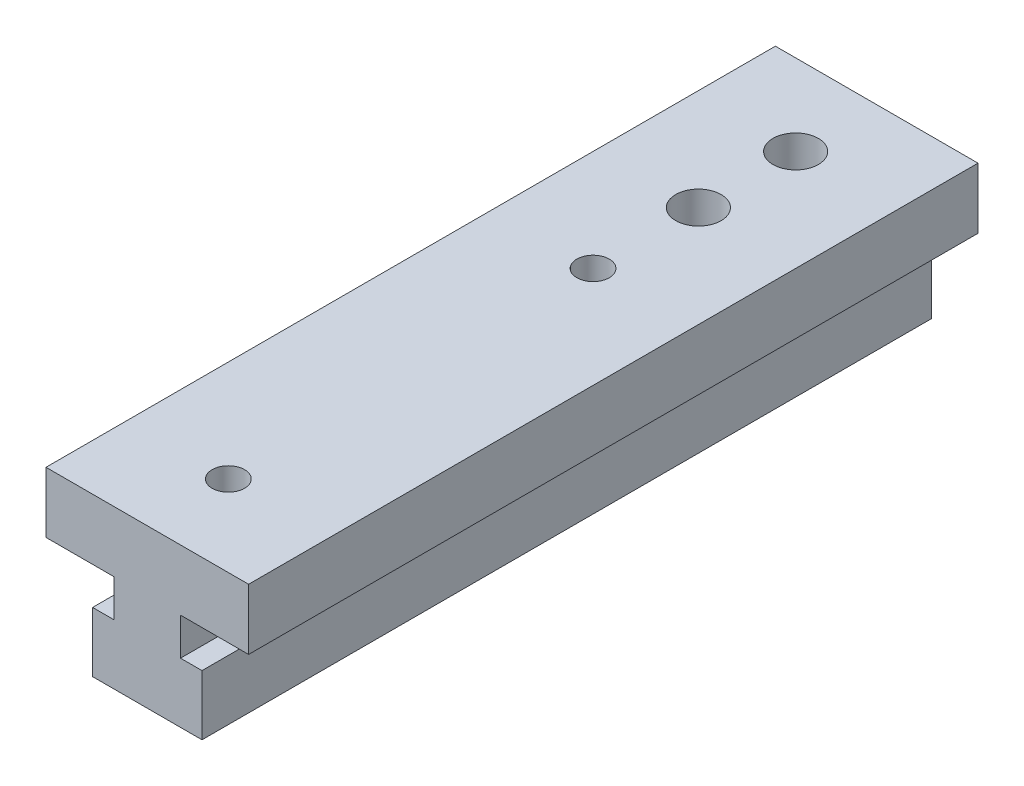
ISO-10303-21;
HEADER;
FILE_DESCRIPTION(('STEP AP214'),'2;1');
FILE_NAME('part.step','',(''),(''),'','','');
FILE_SCHEMA(('AUTOMOTIVE_DESIGN { 1 0 10303 214 1 1 1 1 }'));
ENDSEC;
DATA;
#1=APPLICATION_CONTEXT('core data for automotive mechanical design processes');
#2=APPLICATION_PROTOCOL_DEFINITION('international standard','automotive_design',2000,#1);
#3=PRODUCT_CONTEXT('',#1,'mechanical');
#4=PRODUCT('Part','Part','',(#3));
#5=PRODUCT_RELATED_PRODUCT_CATEGORY('part','',(#4));
#6=PRODUCT_DEFINITION_FORMATION('','',#4);
#7=PRODUCT_DEFINITION_CONTEXT('part definition',#1,'design');
#8=PRODUCT_DEFINITION('design','',#6,#7);
#9=PRODUCT_DEFINITION_SHAPE('','',#8);
#10=(LENGTH_UNIT() NAMED_UNIT(*) SI_UNIT(.MILLI.,.METRE.));
#11=(NAMED_UNIT(*) PLANE_ANGLE_UNIT() SI_UNIT($,.RADIAN.));
#12=(NAMED_UNIT(*) SI_UNIT($,.STERADIAN.) SOLID_ANGLE_UNIT());
#13=UNCERTAINTY_MEASURE_WITH_UNIT(LENGTH_MEASURE(1.E-05),#10,'distance_accuracy_value','');
#14=(GEOMETRIC_REPRESENTATION_CONTEXT(3) GLOBAL_UNCERTAINTY_ASSIGNED_CONTEXT((#13)) GLOBAL_UNIT_ASSIGNED_CONTEXT((#10,
#11,#12)) REPRESENTATION_CONTEXT('',''));
#15=CARTESIAN_POINT('',(0.,0.,0.));
#16=DIRECTION('',(0.,0.,1.));
#17=DIRECTION('',(1.,0.,0.));
#18=AXIS2_PLACEMENT_3D('',#15,#16,#17);
#19=CARTESIAN_POINT('',(0.,-7.,0.));
#20=DIRECTION('',(0.,0.,1.));
#21=DIRECTION('',(1.,0.,0.));
#22=AXIS2_PLACEMENT_3D('',#19,#20,#21);
#23=PLANE('',#22);
#24=CARTESIAN_POINT('',(0.,-7.,0.));
#25=DIRECTION('',(0.,0.,1.));
#26=DIRECTION('',(1.,0.,0.));
#27=AXIS2_PLACEMENT_3D('',#24,#25,#26);
#28=CIRCLE('',#27,1.5);
#29=CARTESIAN_POINT('',(1.5,-7.,0.));
#30=VERTEX_POINT('',#29);
#31=EDGE_CURVE('E18',#30,#30,#28,.F.);
#32=ORIENTED_EDGE('',*,*,#31,.T.);
#33=EDGE_LOOP('',(#32));
#34=FACE_BOUND('',#33,.T.);
#35=ADVANCED_FACE('F15',(#34),#23,.F.);
#36=CARTESIAN_POINT('',(-4.10000610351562,0.,0.));
#37=DIRECTION('',(0.,-1.,0.));
#38=DIRECTION('',(0.,0.,-1.));
#39=AXIS2_PLACEMENT_3D('',#36,#37,#38);
#40=PLANE('',#39);
#41=DIRECTION('',(1.,0.,0.));
#42=VECTOR('',#41,1.);
#43=CARTESIAN_POINT('',(0.,0.,-45.));
#44=LINE('',#43,#42);
#45=CARTESIAN_POINT('',(-12.5,0.,-45.));
#46=VERTEX_POINT('',#45);
#47=CARTESIAN_POINT('',(-4.10000610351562,0.,-45.));
#48=VERTEX_POINT('',#47);
#49=EDGE_CURVE('E117',#46,#48,#44,.T.);
#50=ORIENTED_EDGE('',*,*,#49,.T.);
#51=DIRECTION('',(0.,0.,1.));
#52=VECTOR('',#51,1.);
#53=CARTESIAN_POINT('',(-4.10000610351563,0.,0.));
#54=LINE('',#53,#52);
#55=CARTESIAN_POINT('',(-4.10000610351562,0.,45.));
#56=VERTEX_POINT('',#55);
#57=EDGE_CURVE('E115',#56,#48,#54,.F.);
#58=ORIENTED_EDGE('',*,*,#57,.F.);
#59=DIRECTION('',(1.,0.,0.));
#60=VECTOR('',#59,1.);
#61=CARTESIAN_POINT('',(0.,0.,45.));
#62=LINE('',#61,#60);
#63=CARTESIAN_POINT('',(-12.5,0.,45.));
#64=VERTEX_POINT('',#63);
#65=EDGE_CURVE('E106',#64,#56,#62,.T.);
#66=ORIENTED_EDGE('',*,*,#65,.F.);
#67=DIRECTION('',(0.,0.,1.));
#68=VECTOR('',#67,1.);
#69=CARTESIAN_POINT('',(-12.5,0.,0.));
#70=LINE('',#69,#68);
#71=EDGE_CURVE('E266',#46,#64,#70,.T.);
#72=ORIENTED_EDGE('',*,*,#71,.F.);
#73=EDGE_LOOP('',(#50,#58,#66,#72));
#74=FACE_BOUND('',#73,.T.);
#75=ADVANCED_FACE('F116',(#74),#40,.T.);
#76=CARTESIAN_POINT('',(-4.10000610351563,-4.59999847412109,0.));
#77=DIRECTION('',(-1.,0.,0.));
#78=DIRECTION('',(0.,0.,1.));
#79=AXIS2_PLACEMENT_3D('',#76,#77,#78);
#80=PLANE('',#79);
#81=DIRECTION('',(0.,1.,0.));
#82=VECTOR('',#81,1.);
#83=CARTESIAN_POINT('',(-4.10000610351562,-0.659840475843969,-45.));
#84=LINE('',#83,#82);
#85=CARTESIAN_POINT('',(-4.10000610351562,-4.59999847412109,-45.));
#86=VERTEX_POINT('',#85);
#87=EDGE_CURVE('E261',#48,#86,#84,.F.);
#88=ORIENTED_EDGE('',*,*,#87,.T.);
#89=DIRECTION('',(0.,0.,1.));
#90=VECTOR('',#89,1.);
#91=CARTESIAN_POINT('',(-4.10000610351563,-4.59999847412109,0.));
#92=LINE('',#91,#90);
#93=CARTESIAN_POINT('',(-4.10000610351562,-4.59999847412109,45.));
#94=VERTEX_POINT('',#93);
#95=EDGE_CURVE('E121',#94,#86,#92,.F.);
#96=ORIENTED_EDGE('',*,*,#95,.F.);
#97=DIRECTION('',(0.,1.,0.));
#98=VECTOR('',#97,1.);
#99=CARTESIAN_POINT('',(-4.10000610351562,-0.659840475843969,45.));
#100=LINE('',#99,#98);
#101=EDGE_CURVE('E102',#56,#94,#100,.F.);
#102=ORIENTED_EDGE('',*,*,#101,.F.);
#103=ORIENTED_EDGE('',*,*,#57,.T.);
#104=EDGE_LOOP('',(#88,#96,#102,#103));
#105=FACE_BOUND('',#104,.T.);
#106=ADVANCED_FACE('F123',(#105),#80,.T.);
#107=CARTESIAN_POINT('',(-6.75,-4.59999847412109,0.));
#108=DIRECTION('',(0.,1.,0.));
#109=DIRECTION('',(0.,0.,1.));
#110=AXIS2_PLACEMENT_3D('',#107,#108,#109);
#111=PLANE('',#110);
#112=DIRECTION('',(1.,0.,0.));
#113=VECTOR('',#112,1.);
#114=CARTESIAN_POINT('',(0.,-4.59999847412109,-45.));
#115=LINE('',#114,#113);
#116=CARTESIAN_POINT('',(-6.75,-4.59999847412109,-45.));
#117=VERTEX_POINT('',#116);
#118=EDGE_CURVE('E258',#86,#117,#115,.F.);
#119=ORIENTED_EDGE('',*,*,#118,.T.);
#120=DIRECTION('',(0.,0.,1.));
#121=VECTOR('',#120,1.);
#122=CARTESIAN_POINT('',(-6.75,-4.59999847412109,0.));
#123=LINE('',#122,#121);
#124=CARTESIAN_POINT('',(-6.75,-4.59999847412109,45.));
#125=VERTEX_POINT('',#124);
#126=EDGE_CURVE('E142',#125,#117,#123,.F.);
#127=ORIENTED_EDGE('',*,*,#126,.F.);
#128=DIRECTION('',(1.,0.,0.));
#129=VECTOR('',#128,1.);
#130=CARTESIAN_POINT('',(0.,-4.59999847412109,45.));
#131=LINE('',#130,#129);
#132=EDGE_CURVE('E125',#94,#125,#131,.F.);
#133=ORIENTED_EDGE('',*,*,#132,.F.);
#134=ORIENTED_EDGE('',*,*,#95,.T.);
#135=EDGE_LOOP('',(#119,#127,#133,#134));
#136=FACE_BOUND('',#135,.T.);
#137=ADVANCED_FACE('F326',(#136),#111,.T.);
#138=CARTESIAN_POINT('',(-6.75,-12.,0.));
#139=DIRECTION('',(-1.,0.,0.));
#140=DIRECTION('',(0.,0.,1.));
#141=AXIS2_PLACEMENT_3D('',#138,#139,#140);
#142=PLANE('',#141);
#143=DIRECTION('',(0.,1.,0.));
#144=VECTOR('',#143,1.);
#145=CARTESIAN_POINT('',(-6.75,-0.659840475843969,-45.));
#146=LINE('',#145,#144);
#147=CARTESIAN_POINT('',(-6.75,-12.,-45.));
#148=VERTEX_POINT('',#147);
#149=EDGE_CURVE('E255',#117,#148,#146,.F.);
#150=ORIENTED_EDGE('',*,*,#149,.T.);
#151=DIRECTION('',(0.,0.,-1.));
#152=VECTOR('',#151,1.);
#153=CARTESIAN_POINT('',(-6.75,-12.,0.));
#154=LINE('',#153,#152);
#155=CARTESIAN_POINT('',(-6.75,-12.,45.));
#156=VERTEX_POINT('',#155);
#157=EDGE_CURVE('E134',#156,#148,#154,.T.);
#158=ORIENTED_EDGE('',*,*,#157,.F.);
#159=DIRECTION('',(0.,1.,0.));
#160=VECTOR('',#159,1.);
#161=CARTESIAN_POINT('',(-6.75,-0.659840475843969,45.));
#162=LINE('',#161,#160);
#163=EDGE_CURVE('E127',#125,#156,#162,.F.);
#164=ORIENTED_EDGE('',*,*,#163,.F.);
#165=ORIENTED_EDGE('',*,*,#126,.T.);
#166=EDGE_LOOP('',(#150,#158,#164,#165));
#167=FACE_BOUND('',#166,.T.);
#168=ADVANCED_FACE('F286',(#167),#142,.T.);
#169=CARTESIAN_POINT('',(6.75,-4.59999847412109,0.));
#170=DIRECTION('',(1.,0.,0.));
#171=DIRECTION('',(0.,0.,-1.));
#172=AXIS2_PLACEMENT_3D('',#169,#170,#171);
#173=PLANE('',#172);
#174=DIRECTION('',(0.,1.,0.));
#175=VECTOR('',#174,1.);
#176=CARTESIAN_POINT('',(6.75,-0.659840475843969,-45.));
#177=LINE('',#176,#175);
#178=CARTESIAN_POINT('',(6.75,-12.,-45.));
#179=VERTEX_POINT('',#178);
#180=CARTESIAN_POINT('',(6.75,-4.59999847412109,-45.));
#181=VERTEX_POINT('',#180);
#182=EDGE_CURVE('E249',#179,#181,#177,.T.);
#183=ORIENTED_EDGE('',*,*,#182,.T.);
#184=DIRECTION('',(0.,0.,1.));
#185=VECTOR('',#184,1.);
#186=CARTESIAN_POINT('',(6.75,-4.59999847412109,0.));
#187=LINE('',#186,#185);
#188=CARTESIAN_POINT('',(6.75,-4.59999847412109,45.));
#189=VERTEX_POINT('',#188);
#190=EDGE_CURVE('E140',#189,#181,#187,.F.);
#191=ORIENTED_EDGE('',*,*,#190,.F.);
#192=DIRECTION('',(0.,1.,0.));
#193=VECTOR('',#192,1.);
#194=CARTESIAN_POINT('',(6.75,-0.659840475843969,45.));
#195=LINE('',#194,#193);
#196=CARTESIAN_POINT('',(6.75,-12.,45.));
#197=VERTEX_POINT('',#196);
#198=EDGE_CURVE('E276',#197,#189,#195,.T.);
#199=ORIENTED_EDGE('',*,*,#198,.F.);
#200=DIRECTION('',(0.,0.,-1.));
#201=VECTOR('',#200,1.);
#202=CARTESIAN_POINT('',(6.75,-12.,0.));
#203=LINE('',#202,#201);
#204=EDGE_CURVE('E132',#179,#197,#203,.F.);
#205=ORIENTED_EDGE('',*,*,#204,.F.);
#206=EDGE_LOOP('',(#183,#191,#199,#205));
#207=FACE_BOUND('',#206,.T.);
#208=ADVANCED_FACE('F293',(#207),#173,.T.);
#209=CARTESIAN_POINT('',(4.10000610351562,-4.59999847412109,0.));
#210=DIRECTION('',(0.,1.,0.));
#211=DIRECTION('',(0.,0.,1.));
#212=AXIS2_PLACEMENT_3D('',#209,#210,#211);
#213=PLANE('',#212);
#214=DIRECTION('',(1.,0.,0.));
#215=VECTOR('',#214,1.);
#216=CARTESIAN_POINT('',(0.,-4.59999847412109,-45.));
#217=LINE('',#216,#215);
#218=CARTESIAN_POINT('',(4.10000610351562,-4.59999847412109,-45.));
#219=VERTEX_POINT('',#218);
#220=EDGE_CURVE('E246',#181,#219,#217,.F.);
#221=ORIENTED_EDGE('',*,*,#220,.T.);
#222=DIRECTION('',(0.,0.,-1.));
#223=VECTOR('',#222,1.);
#224=CARTESIAN_POINT('',(4.10000610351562,-4.59999847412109,0.));
#225=LINE('',#224,#223);
#226=CARTESIAN_POINT('',(4.10000610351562,-4.59999847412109,45.));
#227=VERTEX_POINT('',#226);
#228=EDGE_CURVE('E138',#227,#219,#225,.T.);
#229=ORIENTED_EDGE('',*,*,#228,.F.);
#230=DIRECTION('',(1.,0.,0.));
#231=VECTOR('',#230,1.);
#232=CARTESIAN_POINT('',(0.,-4.59999847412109,45.));
#233=LINE('',#232,#231);
#234=EDGE_CURVE('E274',#189,#227,#233,.F.);
#235=ORIENTED_EDGE('',*,*,#234,.F.);
#236=ORIENTED_EDGE('',*,*,#190,.T.);
#237=EDGE_LOOP('',(#221,#229,#235,#236));
#238=FACE_BOUND('',#237,.T.);
#239=ADVANCED_FACE('F301',(#238),#213,.T.);
#240=CARTESIAN_POINT('',(4.10000610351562,0.,0.));
#241=DIRECTION('',(1.,0.,0.));
#242=DIRECTION('',(0.,0.,-1.));
#243=AXIS2_PLACEMENT_3D('',#240,#241,#242);
#244=PLANE('',#243);
#245=DIRECTION('',(0.,1.,0.));
#246=VECTOR('',#245,1.);
#247=CARTESIAN_POINT('',(4.10000610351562,-0.659840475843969,-45.));
#248=LINE('',#247,#246);
#249=CARTESIAN_POINT('',(4.10000610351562,0.,-45.));
#250=VERTEX_POINT('',#249);
#251=EDGE_CURVE('E239',#219,#250,#248,.T.);
#252=ORIENTED_EDGE('',*,*,#251,.T.);
#253=DIRECTION('',(0.,0.,-1.));
#254=VECTOR('',#253,1.);
#255=CARTESIAN_POINT('',(4.10000610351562,0.,0.));
#256=LINE('',#255,#254);
#257=CARTESIAN_POINT('',(4.10000610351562,0.,45.));
#258=VERTEX_POINT('',#257);
#259=EDGE_CURVE('E136',#258,#250,#256,.T.);
#260=ORIENTED_EDGE('',*,*,#259,.F.);
#261=DIRECTION('',(0.,1.,0.));
#262=VECTOR('',#261,1.);
#263=CARTESIAN_POINT('',(4.10000610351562,-0.659840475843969,45.));
#264=LINE('',#263,#262);
#265=EDGE_CURVE('E272',#227,#258,#264,.T.);
#266=ORIENTED_EDGE('',*,*,#265,.F.);
#267=ORIENTED_EDGE('',*,*,#228,.T.);
#268=EDGE_LOOP('',(#252,#260,#266,#267));
#269=FACE_BOUND('',#268,.T.);
#270=ADVANCED_FACE('F308',(#269),#244,.T.);
#271=CARTESIAN_POINT('',(12.5,0.,0.));
#272=DIRECTION('',(0.,-1.,0.));
#273=DIRECTION('',(0.,0.,-1.));
#274=AXIS2_PLACEMENT_3D('',#271,#272,#273);
#275=PLANE('',#274);
#276=DIRECTION('',(1.,0.,0.));
#277=VECTOR('',#276,1.);
#278=CARTESIAN_POINT('',(0.,0.,-45.));
#279=LINE('',#278,#277);
#280=CARTESIAN_POINT('',(12.5,0.,-45.));
#281=VERTEX_POINT('',#280);
#282=EDGE_CURVE('E233',#250,#281,#279,.T.);
#283=ORIENTED_EDGE('',*,*,#282,.T.);
#284=DIRECTION('',(0.,0.,-1.));
#285=VECTOR('',#284,1.);
#286=CARTESIAN_POINT('',(12.5,0.,0.));
#287=LINE('',#286,#285);
#288=CARTESIAN_POINT('',(12.5,0.,45.));
#289=VERTEX_POINT('',#288);
#290=EDGE_CURVE('E112',#289,#281,#287,.T.);
#291=ORIENTED_EDGE('',*,*,#290,.F.);
#292=DIRECTION('',(1.,0.,0.));
#293=VECTOR('',#292,1.);
#294=CARTESIAN_POINT('',(0.,0.,45.));
#295=LINE('',#294,#293);
#296=EDGE_CURVE('E270',#258,#289,#295,.T.);
#297=ORIENTED_EDGE('',*,*,#296,.F.);
#298=ORIENTED_EDGE('',*,*,#259,.T.);
#299=EDGE_LOOP('',(#283,#291,#297,#298));
#300=FACE_BOUND('',#299,.T.);
#301=ADVANCED_FACE('F310',(#300),#275,.T.);
#302=CARTESIAN_POINT('',(0.,-7.,-45.));
#303=DIRECTION('',(0.,0.,1.));
#304=DIRECTION('',(1.,0.,0.));
#305=AXIS2_PLACEMENT_3D('',#302,#303,#304);
#306=CYLINDRICAL_SURFACE('',#305,1.5);
#307=CARTESIAN_POINT('',(-1.5,-7.,-37.3643180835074));
#308=CARTESIAN_POINT('',(-1.49999411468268,-7.07725729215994,-37.3643260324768));
#309=CARTESIAN_POINT('',(-1.49399028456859,-7.15459132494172,-37.3681640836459));
#310=CARTESIAN_POINT('',(-1.47031517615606,-7.3068122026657,-37.3829297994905));
#311=CARTESIAN_POINT('',(-1.45262289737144,-7.38169438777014,-37.3938702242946));
#312=CARTESIAN_POINT('',(-1.40660123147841,-7.52651128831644,-37.4211933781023));
#313=CARTESIAN_POINT('',(-1.3783351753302,-7.59647257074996,-37.4375436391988));
#314=CARTESIAN_POINT('',(-1.31216292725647,-7.73063705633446,-37.4737922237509));
#315=CARTESIAN_POINT('',(-1.27425510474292,-7.79483928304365,-37.493691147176));
#316=CARTESIAN_POINT('',(-1.18563920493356,-7.92241724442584,-37.5371079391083));
#317=CARTESIAN_POINT('',(-1.13405438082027,-7.98512838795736,-37.5607899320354));
#318=CARTESIAN_POINT('',(-1.0213631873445,-8.10153763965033,-37.6077858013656));
#319=CARTESIAN_POINT('',(-0.960251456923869,-8.1552306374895,-37.6310994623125));
#320=CARTESIAN_POINT('',(-0.824263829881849,-8.25631387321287,-37.6769637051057));
#321=CARTESIAN_POINT('',(-0.748676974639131,-8.30285272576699,-37.6993029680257));
#322=CARTESIAN_POINT('',(-0.589323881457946,-8.38224573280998,-37.7385048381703));
#323=CARTESIAN_POINT('',(-0.50556361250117,-8.41510978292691,-37.7553714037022));
#324=CARTESIAN_POINT('',(-0.339310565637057,-8.46347308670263,-37.7805328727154));
#325=CARTESIAN_POINT('',(-0.25724896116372,-8.48014769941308,-37.789403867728));
#326=CARTESIAN_POINT('',(-0.091054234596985,-8.49956451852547,-37.7997539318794));
#327=CARTESIAN_POINT('',(-0.0069226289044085,-8.50231663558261,-37.8012382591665));
#328=CARTESIAN_POINT('',(0.152039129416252,-8.4941827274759,-37.7968870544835));
#329=CARTESIAN_POINT('',(0.226961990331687,-8.48462620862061,-37.7917650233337));
#330=CARTESIAN_POINT('',(0.373951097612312,-8.45457495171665,-37.7759008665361));
#331=CARTESIAN_POINT('',(0.446017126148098,-8.43407938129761,-37.7651583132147));
#332=CARTESIAN_POINT('',(0.586367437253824,-8.38268880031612,-37.7388568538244));
#333=CARTESIAN_POINT('',(0.654596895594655,-8.35167363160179,-37.7232424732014));
#334=CARTESIAN_POINT('',(0.785026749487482,-8.28033772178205,-37.6885487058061));
#335=CARTESIAN_POINT('',(0.84722512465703,-8.2400138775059,-37.6694681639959));
#336=CARTESIAN_POINT('',(0.970753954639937,-8.14640835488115,-37.6272283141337));
#337=CARTESIAN_POINT('',(1.03131879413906,-8.09221434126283,-37.6038511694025));
#338=CARTESIAN_POINT('',(1.14294292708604,-7.97480911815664,-37.5568257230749));
#339=CARTESIAN_POINT('',(1.19399305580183,-7.91158931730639,-37.5331771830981));
#340=CARTESIAN_POINT('',(1.28921732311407,-7.77177294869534,-37.4861537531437));
#341=CARTESIAN_POINT('',(1.33250794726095,-7.69450940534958,-37.4629539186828));
#342=CARTESIAN_POINT('',(1.40517170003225,-7.5323199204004,-37.4222390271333));
#343=CARTESIAN_POINT('',(1.43456067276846,-7.44740283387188,-37.404717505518));
#344=CARTESIAN_POINT('',(1.47606177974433,-7.27946124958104,-37.3794521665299));
#345=CARTESIAN_POINT('',(1.48938229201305,-7.19684227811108,-37.3710303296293));
#346=CARTESIAN_POINT('',(1.5020179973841,-7.03014745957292,-37.3630508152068));
#347=CARTESIAN_POINT('',(1.5013470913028,-6.9460731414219,-37.3634843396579));
#348=CARTESIAN_POINT('',(1.48712683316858,-6.79097344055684,-37.3724453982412));
#349=CARTESIAN_POINT('',(1.47532033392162,-6.71971285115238,-37.3798773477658));
#350=CARTESIAN_POINT('',(1.44188851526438,-6.58036391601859,-37.400278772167));
#351=CARTESIAN_POINT('',(1.42025928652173,-6.51227684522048,-37.413250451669));
#352=CARTESIAN_POINT('',(1.36684573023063,-6.37774308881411,-37.4439140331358));
#353=CARTESIAN_POINT('',(1.33465620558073,-6.31150062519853,-37.4617886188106));
#354=CARTESIAN_POINT('',(1.26137451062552,-6.18496203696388,-37.500128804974));
#355=CARTESIAN_POINT('',(1.22027782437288,-6.12466895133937,-37.5205957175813));
#356=CARTESIAN_POINT('',(1.12323011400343,-6.00234228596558,-37.5654660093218));
#357=CARTESIAN_POINT('',(1.06597881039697,-5.94138404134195,-37.5900020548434));
#358=CARTESIAN_POINT('',(0.941807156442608,-5.82953643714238,-37.6376929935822));
#359=CARTESIAN_POINT('',(0.874881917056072,-5.77865219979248,-37.6608471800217));
#360=CARTESIAN_POINT('',(0.72952912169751,-5.68641632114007,-37.7043997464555));
#361=CARTESIAN_POINT('',(0.650731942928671,-5.64556569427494,-37.7246378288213));
#362=CARTESIAN_POINT('',(0.485990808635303,-5.57813075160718,-37.7587791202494));
#363=CARTESIAN_POINT('',(0.400054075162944,-5.55153221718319,-37.772688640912));
#364=CARTESIAN_POINT('',(0.232672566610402,-5.51593710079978,-37.7914584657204));
#365=CARTESIAN_POINT('',(0.151629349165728,-5.50545469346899,-37.7970803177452));
#366=CARTESIAN_POINT('',(-0.0112485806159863,-5.49783156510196,-37.8011598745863));
#367=CARTESIAN_POINT('',(-0.0930829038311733,-5.50068458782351,-37.7996209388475));
#368=CARTESIAN_POINT('',(-0.248077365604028,-5.51876968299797,-37.7899811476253));
#369=CARTESIAN_POINT('',(-0.321397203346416,-5.53296390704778,-37.7824306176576));
#370=CARTESIAN_POINT('',(-0.464452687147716,-5.57179172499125,-37.7621559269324));
#371=CARTESIAN_POINT('',(-0.534187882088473,-5.59642662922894,-37.7494311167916));
#372=CARTESIAN_POINT('',(-0.671059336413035,-5.65632259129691,-37.7193334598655));
#373=CARTESIAN_POINT('',(-0.738002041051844,-5.69194527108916,-37.701805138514));
#374=CARTESIAN_POINT('',(-0.865199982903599,-5.77236088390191,-37.6638023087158));
#375=CARTESIAN_POINT('',(-0.925452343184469,-5.81715773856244,-37.6433265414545));
#376=CARTESIAN_POINT('',(-1.04464722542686,-5.92037091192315,-37.5986913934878));
#377=CARTESIAN_POINT('',(-1.10270148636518,-5.9797471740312,-37.5743754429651));
#378=CARTESIAN_POINT('',(-1.20843373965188,-6.10749200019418,-37.5264729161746));
#379=CARTESIAN_POINT('',(-1.25610010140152,-6.17587050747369,-37.5028871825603));
#380=CARTESIAN_POINT('',(-1.34217143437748,-6.32446060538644,-37.4578579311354));
#381=CARTESIAN_POINT('',(-1.37991309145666,-6.40511903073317,-37.436606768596));
#382=CARTESIAN_POINT('',(-1.44072320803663,-6.57311230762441,-37.4011624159));
#383=CARTESIAN_POINT('',(-1.46383952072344,-6.66042432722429,-37.3869462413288));
#384=CARTESIAN_POINT('',(-1.48592100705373,-6.79072018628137,-37.3732037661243));
#385=CARTESIAN_POINT('',(-1.49118920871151,-6.83232248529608,-37.3698885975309));
#386=CARTESIAN_POINT('',(-1.49823036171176,-6.91594227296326,-37.3654435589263));
#387=CARTESIAN_POINT('',(-1.50000320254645,-6.95795977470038,-37.3643137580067));
#388=CARTESIAN_POINT('',(-1.5,-7.,-37.3643180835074));
#389=B_SPLINE_CURVE_WITH_KNOTS('',3,(#307,#308,#309,#310,#311,#312,#313,#314,#315,#316,#317,
#318,#319,#320,#321,#322,#323,#324,#325,#326,#327,#328,#329,#330,#331,#332,#333,#334,#335,#336,
#337,#338,#339,#340,#341,#342,#343,#344,#345,#346,#347,#348,#349,#350,#351,#352,#353,#354,#355,
#356,#357,#358,#359,#360,#361,#362,#363,#364,#365,#366,#367,#368,#369,#370,#371,#372,#373,#374,
#375,#376,#377,#378,#379,#380,#381,#382,#383,#384,#385,#386,#387,#388),.UNSPECIFIED.,.T.,.F.,(4,
2,2,2,2,2,2,2,2,2,2,2,2,2,2,2,2,2,2,2,2,2,2,2,2,2,2,2,2,2,2,2,2,2,2,2,2,2,2,2,4),(0.,
0.231594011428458,0.463605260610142,0.694248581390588,0.924930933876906,1.17764557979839,
1.43050295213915,1.70364878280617,1.97659660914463,2.22778733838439,2.47879923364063,
2.70484008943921,2.93089814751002,3.15963049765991,3.38843920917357,3.6410873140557,
3.8939775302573,4.1672116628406,4.44013362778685,4.69091019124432,4.94143761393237,
5.15829662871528,5.37524202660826,5.60173951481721,5.82835210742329,6.08867549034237,
6.34913089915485,6.62073019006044,6.89205801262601,7.13643800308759,7.38070335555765,
7.60487083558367,7.82906645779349,8.06161286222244,8.29425888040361,8.5527365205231,
8.81150208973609,9.08467326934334,9.35694596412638,9.48296586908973,9.60898975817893),.UNSPECIFIED.);
#390=CARTESIAN_POINT('',(-1.5,-7.,-37.3643180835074));
#391=VERTEX_POINT('',#390);
#392=EDGE_CURVE('E222',#391,#391,#389,.T.);
#393=ORIENTED_EDGE('',*,*,#392,.T.);
#394=EDGE_LOOP('',(#393));
#395=FACE_BOUND('',#394,.T.);
#396=CARTESIAN_POINT('',(0.,-7.,-45.));
#397=DIRECTION('',(0.,0.,1.));
#398=DIRECTION('',(1.,0.,0.));
#399=AXIS2_PLACEMENT_3D('',#396,#397,#398);
#400=CIRCLE('',#399,1.5);
#401=CARTESIAN_POINT('',(1.5,-7.,-45.));
#402=VERTEX_POINT('',#401);
#403=EDGE_CURVE('E227',#402,#402,#400,.F.);
#404=ORIENTED_EDGE('',*,*,#403,.T.);
#405=EDGE_LOOP('',(#404));
#406=FACE_BOUND('',#405,.T.);
#407=ADVANCED_FACE('F209',(#395,#406),#306,.F.);
#408=CARTESIAN_POINT('',(0.,-7.,-45.));
#409=DIRECTION('',(0.,0.,1.));
#410=DIRECTION('',(1.,0.,0.));
#411=AXIS2_PLACEMENT_3D('',#408,#409,#410);
#412=CYLINDRICAL_SURFACE('',#411,1.5);
#413=CARTESIAN_POINT('',(-1.5,-7.,-32.6356819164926));
#414=CARTESIAN_POINT('',(-1.49999411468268,-6.92274270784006,-32.6356739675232));
#415=CARTESIAN_POINT('',(-1.49399028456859,-6.84540867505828,-32.6318359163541));
#416=CARTESIAN_POINT('',(-1.47031517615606,-6.6931877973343,-32.6170702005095));
#417=CARTESIAN_POINT('',(-1.45262289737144,-6.61830561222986,-32.6061297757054));
#418=CARTESIAN_POINT('',(-1.40660123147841,-6.47348871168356,-32.5788066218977));
#419=CARTESIAN_POINT('',(-1.3783351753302,-6.40352742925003,-32.5624563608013));
#420=CARTESIAN_POINT('',(-1.31216292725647,-6.26936294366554,-32.5262077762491));
#421=CARTESIAN_POINT('',(-1.27425510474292,-6.20516071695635,-32.506308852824));
#422=CARTESIAN_POINT('',(-1.18563920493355,-6.07758275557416,-32.4628920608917));
#423=CARTESIAN_POINT('',(-1.13405438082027,-6.01487161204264,-32.4392100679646));
#424=CARTESIAN_POINT('',(-1.0213631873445,-5.89846236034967,-32.3922141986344));
#425=CARTESIAN_POINT('',(-0.960251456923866,-5.8447693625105,-32.3689005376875));
#426=CARTESIAN_POINT('',(-0.824263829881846,-5.74368612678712,-32.3230362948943));
#427=CARTESIAN_POINT('',(-0.748676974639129,-5.69714727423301,-32.3006970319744));
#428=CARTESIAN_POINT('',(-0.589323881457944,-5.61775426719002,-32.2614951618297));
#429=CARTESIAN_POINT('',(-0.505563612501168,-5.58489021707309,-32.2446285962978));
#430=CARTESIAN_POINT('',(-0.339310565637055,-5.53652691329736,-32.2194671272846));
#431=CARTESIAN_POINT('',(-0.257248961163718,-5.51985230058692,-32.210596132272));
#432=CARTESIAN_POINT('',(-0.0910542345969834,-5.50043548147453,-32.2002460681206));
#433=CARTESIAN_POINT('',(-0.0069226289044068,-5.49768336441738,-32.1987617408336));
#434=CARTESIAN_POINT('',(0.152039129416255,-5.5058172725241,-32.2031129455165));
#435=CARTESIAN_POINT('',(0.226961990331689,-5.5153737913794,-32.2082349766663));
#436=CARTESIAN_POINT('',(0.373951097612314,-5.54542504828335,-32.2240991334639));
#437=CARTESIAN_POINT('',(0.446017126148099,-5.56592061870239,-32.2348416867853));
#438=CARTESIAN_POINT('',(0.586367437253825,-5.61731119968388,-32.2611431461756));
#439=CARTESIAN_POINT('',(0.654596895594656,-5.6483263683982,-32.2767575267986));
#440=CARTESIAN_POINT('',(0.785026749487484,-5.71966227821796,-32.3114512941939));
#441=CARTESIAN_POINT('',(0.847225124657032,-5.7599861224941,-32.3305318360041));
#442=CARTESIAN_POINT('',(0.970753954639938,-5.85359164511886,-32.3727716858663));
#443=CARTESIAN_POINT('',(1.03131879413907,-5.90778565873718,-32.3961488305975));
#444=CARTESIAN_POINT('',(1.14294292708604,-6.02519088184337,-32.4431742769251));
#445=CARTESIAN_POINT('',(1.19399305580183,-6.08841068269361,-32.4668228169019));
#446=CARTESIAN_POINT('',(1.28921732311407,-6.22822705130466,-32.5138462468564));
#447=CARTESIAN_POINT('',(1.33250794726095,-6.30549059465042,-32.5370460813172));
#448=CARTESIAN_POINT('',(1.40517170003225,-6.46768007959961,-32.5777609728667));
#449=CARTESIAN_POINT('',(1.43456067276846,-6.55259716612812,-32.5952824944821));
#450=CARTESIAN_POINT('',(1.47606177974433,-6.72053875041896,-32.6205478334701));
#451=CARTESIAN_POINT('',(1.48938229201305,-6.80315772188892,-32.6289696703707));
#452=CARTESIAN_POINT('',(1.5020179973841,-6.96985254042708,-32.6369491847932));
#453=CARTESIAN_POINT('',(1.5013470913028,-7.0539268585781,-32.6365156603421));
#454=CARTESIAN_POINT('',(1.48712683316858,-7.20902655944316,-32.6275546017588));
#455=CARTESIAN_POINT('',(1.47532033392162,-7.28028714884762,-32.6201226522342));
#456=CARTESIAN_POINT('',(1.44188851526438,-7.41963608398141,-32.599721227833));
#457=CARTESIAN_POINT('',(1.42025928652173,-7.48772315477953,-32.586749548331));
#458=CARTESIAN_POINT('',(1.36684573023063,-7.62225691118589,-32.5560859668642));
#459=CARTESIAN_POINT('',(1.33465620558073,-7.68849937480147,-32.5382113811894));
#460=CARTESIAN_POINT('',(1.26137451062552,-7.81503796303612,-32.499871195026));
#461=CARTESIAN_POINT('',(1.22027782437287,-7.87533104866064,-32.4794042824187));
#462=CARTESIAN_POINT('',(1.12323011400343,-7.99765771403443,-32.4345339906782));
#463=CARTESIAN_POINT('',(1.06597881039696,-8.05861595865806,-32.4099979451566));
#464=CARTESIAN_POINT('',(0.941807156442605,-8.17046356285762,-32.3623070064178));
#465=CARTESIAN_POINT('',(0.874881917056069,-8.22134780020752,-32.3391528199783));
#466=CARTESIAN_POINT('',(0.729529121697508,-8.31358367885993,-32.2956002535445));
#467=CARTESIAN_POINT('',(0.650731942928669,-8.35443430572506,-32.2753621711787));
#468=CARTESIAN_POINT('',(0.485990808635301,-8.42186924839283,-32.2412208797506));
#469=CARTESIAN_POINT('',(0.400054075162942,-8.44846778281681,-32.227311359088));
#470=CARTESIAN_POINT('',(0.232672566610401,-8.48406289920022,-32.2085415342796));
#471=CARTESIAN_POINT('',(0.151629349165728,-8.49454530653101,-32.2029196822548));
#472=CARTESIAN_POINT('',(-0.0112485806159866,-8.50216843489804,-32.1988401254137));
#473=CARTESIAN_POINT('',(-0.093082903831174,-8.49931541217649,-32.2003790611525));
#474=CARTESIAN_POINT('',(-0.248077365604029,-8.48123031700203,-32.2100188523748));
#475=CARTESIAN_POINT('',(-0.321397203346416,-8.46703609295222,-32.2175693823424));
#476=CARTESIAN_POINT('',(-0.464452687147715,-8.42820827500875,-32.2378440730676));
#477=CARTESIAN_POINT('',(-0.534187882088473,-8.40357337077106,-32.2505688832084));
#478=CARTESIAN_POINT('',(-0.671059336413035,-8.34367740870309,-32.2806665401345));
#479=CARTESIAN_POINT('',(-0.738002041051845,-8.30805472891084,-32.298194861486));
#480=CARTESIAN_POINT('',(-0.8651999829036,-8.22763911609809,-32.3361976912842));
#481=CARTESIAN_POINT('',(-0.92545234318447,-8.18284226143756,-32.3566734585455));
#482=CARTESIAN_POINT('',(-1.04464722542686,-8.07962908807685,-32.4013086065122));
#483=CARTESIAN_POINT('',(-1.10270148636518,-8.0202528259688,-32.4256245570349));
#484=CARTESIAN_POINT('',(-1.20843373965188,-7.89250799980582,-32.4735270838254));
#485=CARTESIAN_POINT('',(-1.25610010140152,-7.82412949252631,-32.4971128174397));
#486=CARTESIAN_POINT('',(-1.34217143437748,-7.67553939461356,-32.5421420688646));
#487=CARTESIAN_POINT('',(-1.37991309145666,-7.59488096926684,-32.563393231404));
#488=CARTESIAN_POINT('',(-1.44072320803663,-7.42688769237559,-32.5988375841));
#489=CARTESIAN_POINT('',(-1.46383952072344,-7.33957567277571,-32.6130537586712));
#490=CARTESIAN_POINT('',(-1.48592100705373,-7.20927981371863,-32.6267962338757));
#491=CARTESIAN_POINT('',(-1.49118920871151,-7.16767751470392,-32.6301114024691));
#492=CARTESIAN_POINT('',(-1.49823036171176,-7.08405772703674,-32.6345564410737));
#493=CARTESIAN_POINT('',(-1.50000320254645,-7.04204022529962,-32.6356862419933));
#494=CARTESIAN_POINT('',(-1.5,-7.,-32.6356819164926));
#495=B_SPLINE_CURVE_WITH_KNOTS('',3,(#413,#414,#415,#416,#417,#418,#419,#420,#421,#422,#423,
#424,#425,#426,#427,#428,#429,#430,#431,#432,#433,#434,#435,#436,#437,#438,#439,#440,#441,#442,
#443,#444,#445,#446,#447,#448,#449,#450,#451,#452,#453,#454,#455,#456,#457,#458,#459,#460,#461,
#462,#463,#464,#465,#466,#467,#468,#469,#470,#471,#472,#473,#474,#475,#476,#477,#478,#479,#480,
#481,#482,#483,#484,#485,#486,#487,#488,#489,#490,#491,#492,#493,#494),.UNSPECIFIED.,.T.,.F.,(4,
2,2,2,2,2,2,2,2,2,2,2,2,2,2,2,2,2,2,2,2,2,2,2,2,2,2,2,2,2,2,2,2,2,2,2,2,2,2,2,4),(0.,
0.231594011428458,0.463605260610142,0.694248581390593,0.924930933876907,1.1776455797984,
1.43050295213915,1.70364878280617,1.97659660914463,2.22778733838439,2.47879923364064,
2.70484008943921,2.93089814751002,3.15963049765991,3.38843920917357,3.6410873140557,
3.8939775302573,4.1672116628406,4.44013362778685,4.69091019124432,4.94143761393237,
5.15829662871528,5.37524202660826,5.60173951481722,5.82835210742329,6.08867549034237,
6.34913089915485,6.62073019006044,6.89205801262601,7.13643800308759,7.38070335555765,
7.60487083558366,7.82906645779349,8.06161286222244,8.29425888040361,8.5527365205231,
8.81150208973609,9.08467326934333,9.35694596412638,9.48296586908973,9.60898975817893),.UNSPECIFIED.);
#496=CARTESIAN_POINT('',(-1.5,-7.,-32.6356819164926));
#497=VERTEX_POINT('',#496);
#498=EDGE_CURVE('E216',#497,#497,#495,.T.);
#499=ORIENTED_EDGE('',*,*,#498,.T.);
#500=EDGE_LOOP('',(#499));
#501=FACE_BOUND('',#500,.T.);
#502=CARTESIAN_POINT('',(-1.5,-7.,-25.3643180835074));
#503=CARTESIAN_POINT('',(-1.49999411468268,-7.07725729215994,-25.3643260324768));
#504=CARTESIAN_POINT('',(-1.49399028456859,-7.15459132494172,-25.3681640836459));
#505=CARTESIAN_POINT('',(-1.47031517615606,-7.3068122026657,-25.3829297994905));
#506=CARTESIAN_POINT('',(-1.45262289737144,-7.38169438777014,-25.3938702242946));
#507=CARTESIAN_POINT('',(-1.40660123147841,-7.52651128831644,-25.4211933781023));
#508=CARTESIAN_POINT('',(-1.3783351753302,-7.59647257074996,-25.4375436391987));
#509=CARTESIAN_POINT('',(-1.31216292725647,-7.73063705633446,-25.4737922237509));
#510=CARTESIAN_POINT('',(-1.27425510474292,-7.79483928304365,-25.493691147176));
#511=CARTESIAN_POINT('',(-1.18563920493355,-7.92241724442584,-25.5371079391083));
#512=CARTESIAN_POINT('',(-1.13405438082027,-7.98512838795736,-25.5607899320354));
#513=CARTESIAN_POINT('',(-1.0213631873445,-8.10153763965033,-25.6077858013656));
#514=CARTESIAN_POINT('',(-0.960251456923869,-8.1552306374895,-25.6310994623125));
#515=CARTESIAN_POINT('',(-0.824263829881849,-8.25631387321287,-25.6769637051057));
#516=CARTESIAN_POINT('',(-0.748676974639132,-8.30285272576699,-25.6993029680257));
#517=CARTESIAN_POINT('',(-0.589323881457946,-8.38224573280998,-25.7385048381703));
#518=CARTESIAN_POINT('',(-0.50556361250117,-8.41510978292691,-25.7553714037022));
#519=CARTESIAN_POINT('',(-0.339310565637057,-8.46347308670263,-25.7805328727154));
#520=CARTESIAN_POINT('',(-0.257248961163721,-8.48014769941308,-25.789403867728));
#521=CARTESIAN_POINT('',(-0.0910542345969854,-8.49956451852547,-25.7997539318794));
#522=CARTESIAN_POINT('',(-0.00692262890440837,-8.50231663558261,-25.8012382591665));
#523=CARTESIAN_POINT('',(0.152039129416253,-8.4941827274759,-25.7968870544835));
#524=CARTESIAN_POINT('',(0.226961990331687,-8.48462620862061,-25.7917650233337));
#525=CARTESIAN_POINT('',(0.373951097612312,-8.45457495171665,-25.7759008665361));
#526=CARTESIAN_POINT('',(0.446017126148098,-8.43407938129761,-25.7651583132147));
#527=CARTESIAN_POINT('',(0.586367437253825,-8.38268880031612,-25.7388568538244));
#528=CARTESIAN_POINT('',(0.654596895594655,-8.3516736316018,-25.7232424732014));
#529=CARTESIAN_POINT('',(0.785026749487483,-8.28033772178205,-25.6885487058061));
#530=CARTESIAN_POINT('',(0.847225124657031,-8.2400138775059,-25.6694681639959));
#531=CARTESIAN_POINT('',(0.970753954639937,-8.14640835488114,-25.6272283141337));
#532=CARTESIAN_POINT('',(1.03131879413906,-8.09221434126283,-25.6038511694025));
#533=CARTESIAN_POINT('',(1.14294292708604,-7.97480911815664,-25.5568257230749));
#534=CARTESIAN_POINT('',(1.19399305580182,-7.9115893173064,-25.5331771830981));
#535=CARTESIAN_POINT('',(1.28921732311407,-7.77177294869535,-25.4861537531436));
#536=CARTESIAN_POINT('',(1.33250794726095,-7.69450940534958,-25.4629539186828));
#537=CARTESIAN_POINT('',(1.40517170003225,-7.5323199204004,-25.4222390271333));
#538=CARTESIAN_POINT('',(1.43456067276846,-7.44740283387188,-25.404717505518));
#539=CARTESIAN_POINT('',(1.47606177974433,-7.27946124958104,-25.3794521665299));
#540=CARTESIAN_POINT('',(1.48938229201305,-7.19684227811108,-25.3710303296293));
#541=CARTESIAN_POINT('',(1.5020179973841,-7.03014745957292,-25.3630508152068));
#542=CARTESIAN_POINT('',(1.5013470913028,-6.9460731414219,-25.3634843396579));
#543=CARTESIAN_POINT('',(1.48712683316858,-6.79097344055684,-25.3724453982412));
#544=CARTESIAN_POINT('',(1.47532033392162,-6.71971285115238,-25.3798773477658));
#545=CARTESIAN_POINT('',(1.44188851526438,-6.58036391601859,-25.400278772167));
#546=CARTESIAN_POINT('',(1.42025928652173,-6.51227684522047,-25.413250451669));
#547=CARTESIAN_POINT('',(1.36684573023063,-6.37774308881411,-25.4439140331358));
#548=CARTESIAN_POINT('',(1.33465620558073,-6.31150062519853,-25.4617886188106));
#549=CARTESIAN_POINT('',(1.26137451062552,-6.18496203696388,-25.500128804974));
#550=CARTESIAN_POINT('',(1.22027782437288,-6.12466895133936,-25.5205957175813));
#551=CARTESIAN_POINT('',(1.12323011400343,-6.00234228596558,-25.5654660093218));
#552=CARTESIAN_POINT('',(1.06597881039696,-5.94138404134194,-25.5900020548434));
#553=CARTESIAN_POINT('',(0.941807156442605,-5.82953643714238,-25.6376929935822));
#554=CARTESIAN_POINT('',(0.874881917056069,-5.77865219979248,-25.6608471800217));
#555=CARTESIAN_POINT('',(0.729529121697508,-5.68641632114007,-25.7043997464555));
#556=CARTESIAN_POINT('',(0.650731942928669,-5.64556569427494,-25.7246378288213));
#557=CARTESIAN_POINT('',(0.485990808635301,-5.57813075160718,-25.7587791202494));
#558=CARTESIAN_POINT('',(0.400054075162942,-5.55153221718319,-25.772688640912));
#559=CARTESIAN_POINT('',(0.232672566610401,-5.51593710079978,-25.7914584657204));
#560=CARTESIAN_POINT('',(0.151629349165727,-5.50545469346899,-25.7970803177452));
#561=CARTESIAN_POINT('',(-0.0112485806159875,-5.49783156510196,-25.8011598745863));
#562=CARTESIAN_POINT('',(-0.0930829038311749,-5.50068458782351,-25.7996209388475));
#563=CARTESIAN_POINT('',(-0.24807736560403,-5.51876968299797,-25.7899811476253));
#564=CARTESIAN_POINT('',(-0.321397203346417,-5.53296390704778,-25.7824306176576));
#565=CARTESIAN_POINT('',(-0.464452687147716,-5.57179172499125,-25.7621559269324));
#566=CARTESIAN_POINT('',(-0.534187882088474,-5.59642662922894,-25.7494311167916));
#567=CARTESIAN_POINT('',(-0.671059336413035,-5.65632259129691,-25.7193334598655));
#568=CARTESIAN_POINT('',(-0.738002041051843,-5.69194527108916,-25.701805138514));
#569=CARTESIAN_POINT('',(-0.865199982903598,-5.77236088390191,-25.6638023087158));
#570=CARTESIAN_POINT('',(-0.925452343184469,-5.81715773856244,-25.6433265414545));
#571=CARTESIAN_POINT('',(-1.04464722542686,-5.92037091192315,-25.5986913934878));
#572=CARTESIAN_POINT('',(-1.10270148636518,-5.9797471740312,-25.5743754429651));
#573=CARTESIAN_POINT('',(-1.20843373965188,-6.10749200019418,-25.5264729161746));
#574=CARTESIAN_POINT('',(-1.25610010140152,-6.1758705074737,-25.5028871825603));
#575=CARTESIAN_POINT('',(-1.34217143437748,-6.32446060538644,-25.4578579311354));
#576=CARTESIAN_POINT('',(-1.37991309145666,-6.40511903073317,-25.436606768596));
#577=CARTESIAN_POINT('',(-1.44072320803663,-6.57311230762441,-25.4011624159));
#578=CARTESIAN_POINT('',(-1.46383952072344,-6.66042432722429,-25.3869462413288));
#579=CARTESIAN_POINT('',(-1.48592100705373,-6.79072018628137,-25.3732037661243));
#580=CARTESIAN_POINT('',(-1.49118920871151,-6.83232248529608,-25.3698885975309));
#581=CARTESIAN_POINT('',(-1.49823036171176,-6.91594227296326,-25.3654435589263));
#582=CARTESIAN_POINT('',(-1.50000320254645,-6.95795977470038,-25.3643137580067));
#583=CARTESIAN_POINT('',(-1.5,-7.,-25.3643180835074));
#584=B_SPLINE_CURVE_WITH_KNOTS('',3,(#502,#503,#504,#505,#506,#507,#508,#509,#510,#511,#512,
#513,#514,#515,#516,#517,#518,#519,#520,#521,#522,#523,#524,#525,#526,#527,#528,#529,#530,#531,
#532,#533,#534,#535,#536,#537,#538,#539,#540,#541,#542,#543,#544,#545,#546,#547,#548,#549,#550,
#551,#552,#553,#554,#555,#556,#557,#558,#559,#560,#561,#562,#563,#564,#565,#566,#567,#568,#569,
#570,#571,#572,#573,#574,#575,#576,#577,#578,#579,#580,#581,#582,#583),.UNSPECIFIED.,.T.,.F.,(4,
2,2,2,2,2,2,2,2,2,2,2,2,2,2,2,2,2,2,2,2,2,2,2,2,2,2,2,2,2,2,2,2,2,2,2,2,2,2,2,4),(0.,
0.231594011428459,0.463605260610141,0.694248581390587,0.924930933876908,1.17764557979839,
1.43050295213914,1.70364878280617,1.97659660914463,2.22778733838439,2.47879923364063,
2.70484008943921,2.93089814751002,3.15963049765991,3.38843920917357,3.64108731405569,
3.8939775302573,4.1672116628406,4.44013362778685,4.69091019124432,4.94143761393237,
5.15829662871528,5.37524202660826,5.60173951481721,5.82835210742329,6.08867549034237,
6.34913089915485,6.62073019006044,6.89205801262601,7.13643800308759,7.38070335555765,
7.60487083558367,7.82906645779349,8.06161286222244,8.29425888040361,8.5527365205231,
8.81150208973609,9.08467326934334,9.35694596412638,9.48296586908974,9.60898975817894),.UNSPECIFIED.);
#585=CARTESIAN_POINT('',(-1.5,-7.,-25.3643180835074));
#586=VERTEX_POINT('',#585);
#587=EDGE_CURVE('E199',#586,#586,#584,.T.);
#588=ORIENTED_EDGE('',*,*,#587,.T.);
#589=EDGE_LOOP('',(#588));
#590=FACE_BOUND('',#589,.T.);
#591=ADVANCED_FACE('F204',(#501,#590),#412,.F.);
#592=CARTESIAN_POINT('',(0.,-7.,-45.));
#593=DIRECTION('',(0.,0.,1.));
#594=DIRECTION('',(1.,0.,0.));
#595=AXIS2_PLACEMENT_3D('',#592,#593,#594);
#596=CYLINDRICAL_SURFACE('',#595,1.5);
#597=ORIENTED_EDGE('',*,*,#31,.F.);
#598=EDGE_LOOP('',(#597));
#599=FACE_BOUND('',#598,.T.);
#600=CARTESIAN_POINT('',(-1.5,-7.,-8.67712434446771));
#601=CARTESIAN_POINT('',(-1.49999219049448,-6.93000257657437,-8.67710809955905));
#602=CARTESIAN_POINT('',(-1.4950410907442,-6.85995416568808,-8.67143633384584));
#603=CARTESIAN_POINT('',(-1.47578333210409,-6.72267014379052,-8.65009355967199));
#604=CARTESIAN_POINT('',(-1.46144878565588,-6.65544355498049,-8.6343927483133));
#605=CARTESIAN_POINT('',(-1.42483838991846,-6.52642015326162,-8.5962487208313));
#606=CARTESIAN_POINT('',(-1.40267483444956,-6.46456122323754,-8.57390151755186));
#607=CARTESIAN_POINT('',(-1.35130655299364,-6.34565454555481,-8.52513544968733));
#608=CARTESIAN_POINT('',(-1.32210267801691,-6.28860621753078,-8.49871707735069));
#609=CARTESIAN_POINT('',(-1.25039909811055,-6.16788720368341,-8.43822687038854));
#610=CARTESIAN_POINT('',(-1.20639573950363,-6.10533206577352,-8.40371095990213));
#611=CARTESIAN_POINT('',(-1.10933596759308,-5.98747453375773,-8.33478835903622));
#612=CARTESIAN_POINT('',(-1.056266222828,-5.93218303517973,-8.30038190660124));
#613=CARTESIAN_POINT('',(-0.929610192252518,-5.81914126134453,-8.2273741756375));
#614=CARTESIAN_POINT('',(-0.854047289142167,-5.76319403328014,-8.18935078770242));
#615=CARTESIAN_POINT('',(-0.691189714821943,-5.66537779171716,-8.12117190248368));
#616=CARTESIAN_POINT('',(-0.60392329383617,-5.62347570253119,-8.09099795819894));
#617=CARTESIAN_POINT('',(-0.447869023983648,-5.56679231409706,-8.04965741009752));
#618=CARTESIAN_POINT('',(-0.381446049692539,-5.54764290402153,-8.03550289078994));
#619=CARTESIAN_POINT('',(-0.245552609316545,-5.51860988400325,-8.01394364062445));
#620=CARTESIAN_POINT('',(-0.176084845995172,-5.50871822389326,-8.00653304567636));
#621=CARTESIAN_POINT('',(-0.035865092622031,-5.49877826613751,-7.99908624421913));
#622=CARTESIAN_POINT('',(0.0348897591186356,-5.49875554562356,-7.99906919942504));
#623=CARTESIAN_POINT('',(0.175316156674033,-5.50861793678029,-8.00645793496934));
#624=CARTESIAN_POINT('',(0.244987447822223,-5.51850534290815,-8.01386543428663));
#625=CARTESIAN_POINT('',(0.378889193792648,-5.54708105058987,-8.03508622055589));
#626=CARTESIAN_POINT('',(0.443224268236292,-5.56545632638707,-8.0486714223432));
#627=CARTESIAN_POINT('',(0.567680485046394,-5.60999564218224,-8.08117721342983));
#628=CARTESIAN_POINT('',(0.627800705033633,-5.63616138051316,-8.10009896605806));
#629=CARTESIAN_POINT('',(0.749216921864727,-5.69852961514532,-8.14438954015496));
#630=CARTESIAN_POINT('',(0.809935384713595,-5.73551209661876,-8.17023459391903));
#631=CARTESIAN_POINT('',(0.924567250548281,-5.81673370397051,-8.22539297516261));
#632=CARTESIAN_POINT('',(0.978474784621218,-5.8609790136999,-8.25470925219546));
#633=CARTESIAN_POINT('',(1.08908204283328,-5.96522334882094,-8.3210623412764));
#634=CARTESIAN_POINT('',(1.14424493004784,-6.0266092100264,-8.35848344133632));
#635=CARTESIAN_POINT('',(1.24400875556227,-6.15783458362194,-8.4327404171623));
#636=CARTESIAN_POINT('',(1.28860466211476,-6.22767809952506,-8.46957600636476));
#637=CARTESIAN_POINT('',(1.358732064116,-6.36098187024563,-8.5318057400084));
#638=CARTESIAN_POINT('',(1.38628866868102,-6.42298704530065,-8.55802400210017));
#639=CARTESIAN_POINT('',(1.43319397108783,-6.55206528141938,-8.60463258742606));
#640=CARTESIAN_POINT('',(1.45256121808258,-6.61912647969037,-8.62503604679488));
#641=CARTESIAN_POINT('',(1.47902385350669,-6.74368694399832,-8.65359949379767));
#642=CARTESIAN_POINT('',(1.48779069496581,-6.80044708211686,-8.66338460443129));
#643=CARTESIAN_POINT('',(1.49871760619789,-6.91535546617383,-8.67564411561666));
#644=CARTESIAN_POINT('',(1.50088612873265,-6.97350183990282,-8.67812786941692));
#645=CARTESIAN_POINT('',(1.49845270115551,-7.0894789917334,-8.67537131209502));
#646=CARTESIAN_POINT('',(1.4938482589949,-7.14730964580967,-8.67012815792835));
#647=CARTESIAN_POINT('',(1.47822527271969,-7.26107615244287,-8.65278781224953));
#648=CARTESIAN_POINT('',(1.46719578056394,-7.3170085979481,-8.64067892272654));
#649=CARTESIAN_POINT('',(1.43413959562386,-7.44633804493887,-8.60572241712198));
#650=CARTESIAN_POINT('',(1.40954189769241,-7.51843595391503,-8.58055176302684));
#651=CARTESIAN_POINT('',(1.35088877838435,-7.65630766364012,-8.52462138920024));
#652=CARTESIAN_POINT('',(1.31681594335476,-7.72206951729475,-8.4938514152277));
#653=CARTESIAN_POINT('',(1.23869774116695,-7.84934900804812,-8.4289171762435));
#654=CARTESIAN_POINT('',(1.19434110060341,-7.91063287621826,-8.39467116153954));
#655=CARTESIAN_POINT('',(1.09682562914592,-8.02600209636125,-8.32652493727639));
#656=CARTESIAN_POINT('',(1.04366252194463,-8.08008392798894,-8.29262490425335));
#657=CARTESIAN_POINT('',(0.916234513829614,-8.19127699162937,-8.22039777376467));
#658=CARTESIAN_POINT('',(0.83989627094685,-8.2464752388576,-8.18271825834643));
#659=CARTESIAN_POINT('',(0.675551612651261,-8.34262073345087,-8.11546895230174));
#660=CARTESIAN_POINT('',(0.587571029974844,-8.38359882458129,-8.08588163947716));
#661=CARTESIAN_POINT('',(0.430755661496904,-8.43843799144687,-8.0458059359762));
#662=CARTESIAN_POINT('',(0.364250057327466,-8.45675679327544,-8.0322452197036));
#663=CARTESIAN_POINT('',(0.228364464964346,-8.48412879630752,-8.01189734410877));
#664=CARTESIAN_POINT('',(0.158987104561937,-8.49319028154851,-8.0051041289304));
#665=CARTESIAN_POINT('',(0.0191476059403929,-8.5015163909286,-7.99886433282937));
#666=CARTESIAN_POINT('',(-0.0513166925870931,-8.50075801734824,-7.99943499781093));
#667=CARTESIAN_POINT('',(-0.191009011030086,-8.48943900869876,-8.0079119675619));
#668=CARTESIAN_POINT('',(-0.260236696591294,-8.47887576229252,-8.01582022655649));
#669=CARTESIAN_POINT('',(-0.393521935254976,-8.44902508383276,-8.03796599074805));
#670=CARTESIAN_POINT('',(-0.457671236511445,-8.42999981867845,-8.05201309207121));
#671=CARTESIAN_POINT('',(-0.581661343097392,-8.38421193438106,-8.08537279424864));
#672=CARTESIAN_POINT('',(-0.641501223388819,-8.35744766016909,-8.10468652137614));
#673=CARTESIAN_POINT('',(-0.762547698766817,-8.29372206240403,-8.1498235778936));
#674=CARTESIAN_POINT('',(-0.823141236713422,-8.25594906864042,-8.17613647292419));
#675=CARTESIAN_POINT('',(-0.937414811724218,-8.17313355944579,-8.23214493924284));
#676=CARTESIAN_POINT('',(-0.991088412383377,-8.12808436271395,-8.26184361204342));
#677=CARTESIAN_POINT('',(-1.10112380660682,-8.0219946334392,-8.32893646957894));
#678=CARTESIAN_POINT('',(-1.15591691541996,-7.95955360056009,-8.36669077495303));
#679=CARTESIAN_POINT('',(-1.25475253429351,-7.82613192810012,-8.44133917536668));
#680=CARTESIAN_POINT('',(-1.29879110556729,-7.75514817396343,-8.47823295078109));
#681=CARTESIAN_POINT('',(-1.36695971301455,-7.62111674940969,-8.53950398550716));
#682=CARTESIAN_POINT('',(-1.39333526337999,-7.55966501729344,-8.56486374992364));
#683=CARTESIAN_POINT('',(-1.438053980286,-7.43191708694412,-8.60967435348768));
#684=CARTESIAN_POINT('',(-1.45641847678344,-7.36563430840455,-8.62914084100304));
#685=CARTESIAN_POINT('',(-1.47997057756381,-7.24921178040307,-8.65467576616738));
#686=CARTESIAN_POINT('',(-1.48744249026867,-7.20003292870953,-8.66299869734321));
#687=CARTESIAN_POINT('',(-1.49745839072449,-7.10057766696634,-8.67422704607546));
#688=CARTESIAN_POINT('',(-1.50000561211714,-7.05030199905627,-8.67713601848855));
#689=CARTESIAN_POINT('',(-1.5,-7.,-8.67712434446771));
#690=B_SPLINE_CURVE_WITH_KNOTS('',3,(#600,#601,#602,#603,#604,#605,#606,#607,#608,#609,#610,
#611,#612,#613,#614,#615,#616,#617,#618,#619,#620,#621,#622,#623,#624,#625,#626,#627,#628,#629,
#630,#631,#632,#633,#634,#635,#636,#637,#638,#639,#640,#641,#642,#643,#644,#645,#646,#647,#648,
#649,#650,#651,#652,#653,#654,#655,#656,#657,#658,#659,#660,#661,#662,#663,#664,#665,#666,#667,
#668,#669,#670,#671,#672,#673,#674,#675,#676,#677,#678,#679,#680,#681,#682,#683,#684,#685,#686,
#687,#688,#689),.UNSPECIFIED.,.T.,.F.,(4,2,2,2,2,2,2,2,2,2,2,2,2,2,2,2,2,2,2,2,2,2,2,2,2,2,2,2,
2,2,2,2,2,2,2,2,2,2,2,2,2,2,2,2,4),(0.,0.209731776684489,0.420089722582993,0.627545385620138,
0.834975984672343,1.08585208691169,1.33710031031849,1.63964848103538,1.94147907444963,
2.15227725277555,2.36289195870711,2.57405250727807,2.78526195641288,2.9892375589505,
3.19325766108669,3.41936844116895,3.64567274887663,3.91649517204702,4.18744629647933,
4.40499409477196,4.62204646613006,4.79608005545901,4.96989060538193,5.14376512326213,
5.31793678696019,5.55730028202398,5.79710662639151,6.0454320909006,6.29387849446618,
6.59652499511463,6.89851088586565,7.10852896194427,7.31835893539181,7.52868041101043,
7.73905791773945,7.94332812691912,8.14764205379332,8.3751005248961,8.60276905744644,
8.87547580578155,9.14828228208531,9.36218279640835,9.57551025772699,9.72632812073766,
9.87704692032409),.UNSPECIFIED.);
#691=CARTESIAN_POINT('',(-1.5,-7.,-8.67712434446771));
#692=VERTEX_POINT('',#691);
#693=EDGE_CURVE('E168',#692,#692,#690,.T.);
#694=ORIENTED_EDGE('',*,*,#693,.T.);
#695=EDGE_LOOP('',(#694));
#696=FACE_BOUND('',#695,.T.);
#697=ADVANCED_FACE('F208',(#599,#696),#596,.F.);
#698=CARTESIAN_POINT('',(0.,-7.,-45.));
#699=DIRECTION('',(0.,0.,1.));
#700=DIRECTION('',(1.,0.,0.));
#701=AXIS2_PLACEMENT_3D('',#698,#699,#700);
#702=CYLINDRICAL_SURFACE('',#701,1.5);
#703=CARTESIAN_POINT('',(-1.5,-7.,-20.6356819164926));
#704=CARTESIAN_POINT('',(-1.49999411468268,-6.92274270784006,-20.6356739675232));
#705=CARTESIAN_POINT('',(-1.49399028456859,-6.84540867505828,-20.6318359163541));
#706=CARTESIAN_POINT('',(-1.47031517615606,-6.6931877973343,-20.6170702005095));
#707=CARTESIAN_POINT('',(-1.45262289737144,-6.61830561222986,-20.6061297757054));
#708=CARTESIAN_POINT('',(-1.40660123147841,-6.47348871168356,-20.5788066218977));
#709=CARTESIAN_POINT('',(-1.3783351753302,-6.40352742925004,-20.5624563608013));
#710=CARTESIAN_POINT('',(-1.31216292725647,-6.26936294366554,-20.5262077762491));
#711=CARTESIAN_POINT('',(-1.27425510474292,-6.20516071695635,-20.506308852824));
#712=CARTESIAN_POINT('',(-1.18563920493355,-6.07758275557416,-20.4628920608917));
#713=CARTESIAN_POINT('',(-1.13405438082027,-6.01487161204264,-20.4392100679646));
#714=CARTESIAN_POINT('',(-1.0213631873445,-5.89846236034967,-20.3922141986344));
#715=CARTESIAN_POINT('',(-0.960251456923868,-5.8447693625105,-20.3689005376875));
#716=CARTESIAN_POINT('',(-0.824263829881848,-5.74368612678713,-20.3230362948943));
#717=CARTESIAN_POINT('',(-0.74867697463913,-5.69714727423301,-20.3006970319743));
#718=CARTESIAN_POINT('',(-0.589323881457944,-5.61775426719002,-20.2614951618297));
#719=CARTESIAN_POINT('',(-0.505563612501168,-5.58489021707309,-20.2446285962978));
#720=CARTESIAN_POINT('',(-0.339310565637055,-5.53652691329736,-20.2194671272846));
#721=CARTESIAN_POINT('',(-0.257248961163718,-5.51985230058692,-20.210596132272));
#722=CARTESIAN_POINT('',(-0.091054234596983,-5.50043548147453,-20.2002460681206));
#723=CARTESIAN_POINT('',(-0.00692262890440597,-5.49768336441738,-20.1987617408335));
#724=CARTESIAN_POINT('',(0.152039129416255,-5.5058172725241,-20.2031129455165));
#725=CARTESIAN_POINT('',(0.226961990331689,-5.51537379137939,-20.2082349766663));
#726=CARTESIAN_POINT('',(0.373951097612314,-5.54542504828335,-20.2240991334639));
#727=CARTESIAN_POINT('',(0.4460171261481,-5.56592061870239,-20.2348416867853));
#728=CARTESIAN_POINT('',(0.586367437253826,-5.61731119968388,-20.2611431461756));
#729=CARTESIAN_POINT('',(0.654596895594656,-5.6483263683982,-20.2767575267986));
#730=CARTESIAN_POINT('',(0.785026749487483,-5.71966227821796,-20.3114512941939));
#731=CARTESIAN_POINT('',(0.847225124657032,-5.7599861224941,-20.3305318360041));
#732=CARTESIAN_POINT('',(0.970753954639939,-5.85359164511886,-20.3727716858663));
#733=CARTESIAN_POINT('',(1.03131879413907,-5.90778565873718,-20.3961488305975));
#734=CARTESIAN_POINT('',(1.14294292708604,-6.02519088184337,-20.4431742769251));
#735=CARTESIAN_POINT('',(1.19399305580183,-6.08841068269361,-20.4668228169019));
#736=CARTESIAN_POINT('',(1.28921732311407,-6.22822705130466,-20.5138462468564));
#737=CARTESIAN_POINT('',(1.33250794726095,-6.30549059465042,-20.5370460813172));
#738=CARTESIAN_POINT('',(1.40517170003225,-6.46768007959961,-20.5777609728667));
#739=CARTESIAN_POINT('',(1.43456067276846,-6.55259716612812,-20.595282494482));
#740=CARTESIAN_POINT('',(1.47606177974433,-6.72053875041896,-20.6205478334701));
#741=CARTESIAN_POINT('',(1.48938229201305,-6.80315772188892,-20.6289696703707));
#742=CARTESIAN_POINT('',(1.5020179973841,-6.96985254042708,-20.6369491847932));
#743=CARTESIAN_POINT('',(1.5013470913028,-7.0539268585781,-20.6365156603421));
#744=CARTESIAN_POINT('',(1.48712683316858,-7.20902655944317,-20.6275546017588));
#745=CARTESIAN_POINT('',(1.47532033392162,-7.28028714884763,-20.6201226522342));
#746=CARTESIAN_POINT('',(1.44188851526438,-7.41963608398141,-20.599721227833));
#747=CARTESIAN_POINT('',(1.42025928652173,-7.48772315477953,-20.586749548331));
#748=CARTESIAN_POINT('',(1.36684573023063,-7.62225691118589,-20.5560859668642));
#749=CARTESIAN_POINT('',(1.33465620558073,-7.68849937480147,-20.5382113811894));
#750=CARTESIAN_POINT('',(1.26137451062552,-7.81503796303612,-20.499871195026));
#751=CARTESIAN_POINT('',(1.22027782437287,-7.87533104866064,-20.4794042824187));
#752=CARTESIAN_POINT('',(1.12323011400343,-7.99765771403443,-20.4345339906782));
#753=CARTESIAN_POINT('',(1.06597881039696,-8.05861595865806,-20.4099979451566));
#754=CARTESIAN_POINT('',(0.941807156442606,-8.17046356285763,-20.3623070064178));
#755=CARTESIAN_POINT('',(0.874881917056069,-8.22134780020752,-20.3391528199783));
#756=CARTESIAN_POINT('',(0.729529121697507,-8.31358367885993,-20.2956002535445));
#757=CARTESIAN_POINT('',(0.650731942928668,-8.35443430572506,-20.2753621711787));
#758=CARTESIAN_POINT('',(0.4859908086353,-8.42186924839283,-20.2412208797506));
#759=CARTESIAN_POINT('',(0.40005407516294,-8.44846778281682,-20.227311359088));
#760=CARTESIAN_POINT('',(0.232672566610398,-8.48406289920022,-20.2085415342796));
#761=CARTESIAN_POINT('',(0.151629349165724,-8.49454530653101,-20.2029196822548));
#762=CARTESIAN_POINT('',(-0.0112485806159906,-8.50216843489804,-20.1988401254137));
#763=CARTESIAN_POINT('',(-0.0930829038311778,-8.49931541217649,-20.2003790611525));
#764=CARTESIAN_POINT('',(-0.248077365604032,-8.48123031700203,-20.2100188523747));
#765=CARTESIAN_POINT('',(-0.321397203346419,-8.46703609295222,-20.2175693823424));
#766=CARTESIAN_POINT('',(-0.464452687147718,-8.42820827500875,-20.2378440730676));
#767=CARTESIAN_POINT('',(-0.534187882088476,-8.40357337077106,-20.2505688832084));
#768=CARTESIAN_POINT('',(-0.671059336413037,-8.34367740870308,-20.2806665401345));
#769=CARTESIAN_POINT('',(-0.738002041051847,-8.30805472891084,-20.298194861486));
#770=CARTESIAN_POINT('',(-0.865199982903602,-8.22763911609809,-20.3361976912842));
#771=CARTESIAN_POINT('',(-0.925452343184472,-8.18284226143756,-20.3566734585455));
#772=CARTESIAN_POINT('',(-1.04464722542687,-8.07962908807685,-20.4013086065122));
#773=CARTESIAN_POINT('',(-1.10270148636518,-8.0202528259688,-20.4256245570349));
#774=CARTESIAN_POINT('',(-1.20843373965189,-7.89250799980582,-20.4735270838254));
#775=CARTESIAN_POINT('',(-1.25610010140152,-7.8241294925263,-20.4971128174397));
#776=CARTESIAN_POINT('',(-1.34217143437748,-7.67553939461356,-20.5421420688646));
#777=CARTESIAN_POINT('',(-1.37991309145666,-7.59488096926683,-20.563393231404));
#778=CARTESIAN_POINT('',(-1.44072320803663,-7.42688769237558,-20.5988375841));
#779=CARTESIAN_POINT('',(-1.46383952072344,-7.33957567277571,-20.6130537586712));
#780=CARTESIAN_POINT('',(-1.48592100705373,-7.20927981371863,-20.6267962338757));
#781=CARTESIAN_POINT('',(-1.49118920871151,-7.16767751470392,-20.6301114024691));
#782=CARTESIAN_POINT('',(-1.49823036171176,-7.08405772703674,-20.6345564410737));
#783=CARTESIAN_POINT('',(-1.50000320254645,-7.04204022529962,-20.6356862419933));
#784=CARTESIAN_POINT('',(-1.5,-7.,-20.6356819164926));
#785=B_SPLINE_CURVE_WITH_KNOTS('',3,(#703,#704,#705,#706,#707,#708,#709,#710,#711,#712,#713,
#714,#715,#716,#717,#718,#719,#720,#721,#722,#723,#724,#725,#726,#727,#728,#729,#730,#731,#732,
#733,#734,#735,#736,#737,#738,#739,#740,#741,#742,#743,#744,#745,#746,#747,#748,#749,#750,#751,
#752,#753,#754,#755,#756,#757,#758,#759,#760,#761,#762,#763,#764,#765,#766,#767,#768,#769,#770,
#771,#772,#773,#774,#775,#776,#777,#778,#779,#780,#781,#782,#783,#784),.UNSPECIFIED.,.T.,.F.,(4,
2,2,2,2,2,2,2,2,2,2,2,2,2,2,2,2,2,2,2,2,2,2,2,2,2,2,2,2,2,2,2,2,2,2,2,2,2,2,2,4),(0.,
0.231594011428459,0.463605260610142,0.694248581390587,0.924930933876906,1.17764557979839,
1.43050295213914,1.70364878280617,1.97659660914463,2.22778733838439,2.47879923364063,
2.70484008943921,2.93089814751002,3.15963049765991,3.38843920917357,3.6410873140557,
3.8939775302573,4.1672116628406,4.44013362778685,4.69091019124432,4.94143761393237,
5.15829662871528,5.37524202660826,5.60173951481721,5.82835210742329,6.08867549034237,
6.34913089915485,6.62073019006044,6.89205801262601,7.13643800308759,7.38070335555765,
7.60487083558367,7.82906645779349,8.06161286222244,8.29425888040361,8.5527365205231,
8.81150208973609,9.08467326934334,9.35694596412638,9.48296586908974,9.60898975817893),.UNSPECIFIED.);
#786=CARTESIAN_POINT('',(-1.5,-7.,-20.6356819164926));
#787=VERTEX_POINT('',#786);
#788=EDGE_CURVE('E195',#787,#787,#785,.T.);
#789=ORIENTED_EDGE('',*,*,#788,.T.);
#790=EDGE_LOOP('',(#789));
#791=FACE_BOUND('',#790,.T.);
#792=CARTESIAN_POINT('',(-1.5,-7.,-11.3228756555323));
#793=CARTESIAN_POINT('',(-1.49999219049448,-7.06999742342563,-11.3228919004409));
#794=CARTESIAN_POINT('',(-1.4950410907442,-7.14004583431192,-11.3285636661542));
#795=CARTESIAN_POINT('',(-1.47578333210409,-7.27732985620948,-11.349906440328));
#796=CARTESIAN_POINT('',(-1.46144878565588,-7.34455644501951,-11.3656072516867));
#797=CARTESIAN_POINT('',(-1.42483838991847,-7.47357984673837,-11.4037512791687));
#798=CARTESIAN_POINT('',(-1.40267483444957,-7.53543877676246,-11.4260984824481));
#799=CARTESIAN_POINT('',(-1.35130655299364,-7.65434545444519,-11.4748645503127));
#800=CARTESIAN_POINT('',(-1.32210267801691,-7.71139378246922,-11.5012829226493));
#801=CARTESIAN_POINT('',(-1.25039909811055,-7.83211279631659,-11.5617731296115));
#802=CARTESIAN_POINT('',(-1.20639573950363,-7.89466793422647,-11.5962890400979));
#803=CARTESIAN_POINT('',(-1.10933596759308,-8.01252546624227,-11.6652116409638));
#804=CARTESIAN_POINT('',(-1.056266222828,-8.06781696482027,-11.6996180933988));
#805=CARTESIAN_POINT('',(-0.92961019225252,-8.18085873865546,-11.7726258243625));
#806=CARTESIAN_POINT('',(-0.854047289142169,-8.23680596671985,-11.8106492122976));
#807=CARTESIAN_POINT('',(-0.691189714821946,-8.33462220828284,-11.8788280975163));
#808=CARTESIAN_POINT('',(-0.603923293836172,-8.37652429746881,-11.9090020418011));
#809=CARTESIAN_POINT('',(-0.447869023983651,-8.43320768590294,-11.9503425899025));
#810=CARTESIAN_POINT('',(-0.381446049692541,-8.45235709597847,-11.9644971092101));
#811=CARTESIAN_POINT('',(-0.245552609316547,-8.48139011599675,-11.9860563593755));
#812=CARTESIAN_POINT('',(-0.176084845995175,-8.49128177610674,-11.9934669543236));
#813=CARTESIAN_POINT('',(-0.0358650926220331,-8.50122173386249,-12.0009137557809));
#814=CARTESIAN_POINT('',(0.0348897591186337,-8.50124445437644,-12.000930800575));
#815=CARTESIAN_POINT('',(0.175316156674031,-8.49138206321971,-11.9935420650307));
#816=CARTESIAN_POINT('',(0.244987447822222,-8.48149465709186,-11.9861345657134));
#817=CARTESIAN_POINT('',(0.378889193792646,-8.45291894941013,-11.9649137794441));
#818=CARTESIAN_POINT('',(0.443224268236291,-8.43454367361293,-11.9513285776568));
#819=CARTESIAN_POINT('',(0.567680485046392,-8.39000435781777,-11.9188227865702));
#820=CARTESIAN_POINT('',(0.627800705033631,-8.36383861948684,-11.8999010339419));
#821=CARTESIAN_POINT('',(0.749216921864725,-8.30147038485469,-11.855610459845));
#822=CARTESIAN_POINT('',(0.809935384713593,-8.26448790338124,-11.829765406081));
#823=CARTESIAN_POINT('',(0.924567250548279,-8.18326629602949,-11.7746070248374));
#824=CARTESIAN_POINT('',(0.978474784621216,-8.13902098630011,-11.7452907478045));
#825=CARTESIAN_POINT('',(1.08908204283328,-8.03477665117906,-11.6789376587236));
#826=CARTESIAN_POINT('',(1.14424493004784,-7.97339078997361,-11.6415165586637));
#827=CARTESIAN_POINT('',(1.24400875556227,-7.84216541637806,-11.5672595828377));
#828=CARTESIAN_POINT('',(1.28860466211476,-7.77232190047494,-11.5304239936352));
#829=CARTESIAN_POINT('',(1.358732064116,-7.63901812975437,-11.4681942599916));
#830=CARTESIAN_POINT('',(1.38628866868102,-7.57701295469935,-11.4419759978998));
#831=CARTESIAN_POINT('',(1.43319397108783,-7.44793471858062,-11.3953674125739));
#832=CARTESIAN_POINT('',(1.45256121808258,-7.38087352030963,-11.3749639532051));
#833=CARTESIAN_POINT('',(1.47902385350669,-7.25631305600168,-11.3464005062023));
#834=CARTESIAN_POINT('',(1.48779069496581,-7.19955291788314,-11.3366153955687));
#835=CARTESIAN_POINT('',(1.49871760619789,-7.08464453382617,-11.3243558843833));
#836=CARTESIAN_POINT('',(1.50088612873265,-7.02649816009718,-11.3218721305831));
#837=CARTESIAN_POINT('',(1.49845270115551,-6.9105210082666,-11.324628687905));
#838=CARTESIAN_POINT('',(1.4938482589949,-6.85269035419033,-11.3298718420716));
#839=CARTESIAN_POINT('',(1.47822527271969,-6.73892384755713,-11.3472121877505));
#840=CARTESIAN_POINT('',(1.46719578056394,-6.6829914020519,-11.3593210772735));
#841=CARTESIAN_POINT('',(1.43413959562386,-6.55366195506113,-11.394277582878));
#842=CARTESIAN_POINT('',(1.40954189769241,-6.48156404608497,-11.4194482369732));
#843=CARTESIAN_POINT('',(1.35088877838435,-6.34369233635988,-11.4753786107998));
#844=CARTESIAN_POINT('',(1.31681594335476,-6.27793048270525,-11.5061485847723));
#845=CARTESIAN_POINT('',(1.23869774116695,-6.15065099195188,-11.5710828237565));
#846=CARTESIAN_POINT('',(1.19434110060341,-6.08936712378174,-11.6053288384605));
#847=CARTESIAN_POINT('',(1.09682562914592,-5.97399790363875,-11.6734750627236));
#848=CARTESIAN_POINT('',(1.04366252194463,-5.91991607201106,-11.7073750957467));
#849=CARTESIAN_POINT('',(0.916234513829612,-5.80872300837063,-11.7796022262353));
#850=CARTESIAN_POINT('',(0.839896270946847,-5.7535247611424,-11.8172817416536));
#851=CARTESIAN_POINT('',(0.675551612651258,-5.65737926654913,-11.8845310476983));
#852=CARTESIAN_POINT('',(0.587571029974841,-5.61640117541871,-11.9141183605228));
#853=CARTESIAN_POINT('',(0.430755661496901,-5.56156200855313,-11.9541940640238));
#854=CARTESIAN_POINT('',(0.364250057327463,-5.54324320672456,-11.9677547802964));
#855=CARTESIAN_POINT('',(0.228364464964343,-5.51587120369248,-11.9881026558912));
#856=CARTESIAN_POINT('',(0.158987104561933,-5.50680971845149,-11.9948958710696));
#857=CARTESIAN_POINT('',(0.0191476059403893,-5.4984836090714,-12.0011356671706));
#858=CARTESIAN_POINT('',(-0.0513166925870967,-5.49924198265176,-12.0005650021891));
#859=CARTESIAN_POINT('',(-0.191009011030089,-5.51056099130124,-11.9920880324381));
#860=CARTESIAN_POINT('',(-0.260236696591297,-5.52112423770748,-11.9841797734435));
#861=CARTESIAN_POINT('',(-0.39352193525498,-5.55097491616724,-11.9620340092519));
#862=CARTESIAN_POINT('',(-0.457671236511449,-5.57000018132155,-11.9479869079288));
#863=CARTESIAN_POINT('',(-0.581661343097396,-5.61578806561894,-11.9146272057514));
#864=CARTESIAN_POINT('',(-0.641501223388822,-5.64255233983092,-11.8953134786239));
#865=CARTESIAN_POINT('',(-0.76254769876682,-5.70627793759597,-11.8501764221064));
#866=CARTESIAN_POINT('',(-0.823141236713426,-5.74405093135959,-11.8238635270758));
#867=CARTESIAN_POINT('',(-0.937414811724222,-5.82686644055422,-11.7678550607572));
#868=CARTESIAN_POINT('',(-0.991088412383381,-5.87191563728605,-11.7381563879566));
#869=CARTESIAN_POINT('',(-1.10112380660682,-5.9780053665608,-11.6710635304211));
#870=CARTESIAN_POINT('',(-1.15591691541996,-6.04044639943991,-11.633309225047));
#871=CARTESIAN_POINT('',(-1.25475253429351,-6.17386807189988,-11.5586608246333));
#872=CARTESIAN_POINT('',(-1.29879110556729,-6.24485182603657,-11.5217670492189));
#873=CARTESIAN_POINT('',(-1.36695971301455,-6.37888325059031,-11.4604960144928));
#874=CARTESIAN_POINT('',(-1.39333526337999,-6.44033498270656,-11.4351362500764));
#875=CARTESIAN_POINT('',(-1.438053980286,-6.56808291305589,-11.3903256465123));
#876=CARTESIAN_POINT('',(-1.45641847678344,-6.63436569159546,-11.370859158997));
#877=CARTESIAN_POINT('',(-1.47997057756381,-6.75078821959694,-11.3453242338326));
#878=CARTESIAN_POINT('',(-1.48744249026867,-6.79996707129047,-11.3370013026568));
#879=CARTESIAN_POINT('',(-1.49745839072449,-6.89942233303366,-11.3257729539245));
#880=CARTESIAN_POINT('',(-1.50000561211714,-6.94969800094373,-11.3228639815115));
#881=CARTESIAN_POINT('',(-1.5,-7.,-11.3228756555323));
#882=B_SPLINE_CURVE_WITH_KNOTS('',3,(#792,#793,#794,#795,#796,#797,#798,#799,#800,#801,#802,
#803,#804,#805,#806,#807,#808,#809,#810,#811,#812,#813,#814,#815,#816,#817,#818,#819,#820,#821,
#822,#823,#824,#825,#826,#827,#828,#829,#830,#831,#832,#833,#834,#835,#836,#837,#838,#839,#840,
#841,#842,#843,#844,#845,#846,#847,#848,#849,#850,#851,#852,#853,#854,#855,#856,#857,#858,#859,
#860,#861,#862,#863,#864,#865,#866,#867,#868,#869,#870,#871,#872,#873,#874,#875,#876,#877,#878,
#879,#880,#881),.UNSPECIFIED.,.T.,.F.,(4,2,2,2,2,2,2,2,2,2,2,2,2,2,2,2,2,2,2,2,2,2,2,2,2,2,2,2,
2,2,2,2,2,2,2,2,2,2,2,2,2,2,2,2,4),(0.,0.20973177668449,0.420089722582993,0.627545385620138,
0.834975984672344,1.08585208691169,1.33710031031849,1.63964848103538,1.94147907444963,
2.15227725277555,2.36289195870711,2.57405250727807,2.78526195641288,2.9892375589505,
3.19325766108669,3.41936844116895,3.64567274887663,3.91649517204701,4.18744629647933,
4.40499409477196,4.62204646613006,4.79608005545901,4.96989060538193,5.14376512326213,
5.31793678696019,5.55730028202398,5.79710662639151,6.0454320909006,6.29387849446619,
6.59652499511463,6.89851088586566,7.10852896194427,7.31835893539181,7.52868041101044,
7.73905791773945,7.94332812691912,8.14764205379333,8.37510052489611,8.60276905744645,
8.87547580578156,9.14828228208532,9.36218279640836,9.57551025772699,9.72632812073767,
9.87704692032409),.UNSPECIFIED.);
#883=CARTESIAN_POINT('',(-1.5,-7.,-11.3228756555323));
#884=VERTEX_POINT('',#883);
#885=EDGE_CURVE('E161',#884,#884,#882,.T.);
#886=ORIENTED_EDGE('',*,*,#885,.T.);
#887=EDGE_LOOP('',(#886));
#888=FACE_BOUND('',#887,.T.);
#889=ADVANCED_FACE('F173',(#791,#888),#702,.F.);
#890=CARTESIAN_POINT('',(6.75,-12.,0.));
#891=DIRECTION('',(0.,-1.,0.));
#892=DIRECTION('',(0.,0.,-1.));
#893=AXIS2_PLACEMENT_3D('',#890,#891,#892);
#894=PLANE('',#893);
#895=CARTESIAN_POINT('',(0.,-12.,35.));
#896=DIRECTION('',(0.,-1.,0.));
#897=DIRECTION('',(1.,0.,0.));
#898=AXIS2_PLACEMENT_3D('',#895,#896,#897);
#899=CIRCLE('',#898,2.);
#900=CARTESIAN_POINT('',(2.,-12.,35.));
#901=VERTEX_POINT('',#900);
#902=EDGE_CURVE('E154',#901,#901,#899,.F.);
#903=ORIENTED_EDGE('',*,*,#902,.T.);
#904=EDGE_LOOP('',(#903));
#905=FACE_BOUND('',#904,.T.);
#906=CARTESIAN_POINT('',(0.,-12.,-10.));
#907=DIRECTION('',(0.,-1.,0.));
#908=DIRECTION('',(1.,0.,0.));
#909=AXIS2_PLACEMENT_3D('',#906,#907,#908);
#910=CIRCLE('',#909,2.);
#911=CARTESIAN_POINT('',(2.,-12.,-10.));
#912=VERTEX_POINT('',#911);
#913=EDGE_CURVE('E158',#912,#912,#910,.F.);
#914=ORIENTED_EDGE('',*,*,#913,.T.);
#915=EDGE_LOOP('',(#914));
#916=FACE_BOUND('',#915,.T.);
#917=CARTESIAN_POINT('',(0.,-12.,-23.));
#918=DIRECTION('',(0.,-1.,0.));
#919=DIRECTION('',(1.,0.,0.));
#920=AXIS2_PLACEMENT_3D('',#917,#918,#919);
#921=CIRCLE('',#920,2.8);
#922=CARTESIAN_POINT('',(2.8,-12.,-23.));
#923=VERTEX_POINT('',#922);
#924=EDGE_CURVE('E485',#923,#923,#921,.F.);
#925=ORIENTED_EDGE('',*,*,#924,.T.);
#926=EDGE_LOOP('',(#925));
#927=FACE_BOUND('',#926,.T.);
#928=CARTESIAN_POINT('',(0.,-12.,-35.));
#929=DIRECTION('',(0.,-1.,0.));
#930=DIRECTION('',(1.,0.,0.));
#931=AXIS2_PLACEMENT_3D('',#928,#929,#930);
#932=CIRCLE('',#931,2.8);
#933=CARTESIAN_POINT('',(2.8,-12.,-35.));
#934=VERTEX_POINT('',#933);
#935=EDGE_CURVE('E223',#934,#934,#932,.F.);
#936=ORIENTED_EDGE('',*,*,#935,.T.);
#937=EDGE_LOOP('',(#936));
#938=FACE_BOUND('',#937,.T.);
#939=DIRECTION('',(1.,0.,0.));
#940=VECTOR('',#939,1.);
#941=CARTESIAN_POINT('',(0.,-12.,-45.));
#942=LINE('',#941,#940);
#943=EDGE_CURVE('E252',#148,#179,#942,.T.);
#944=ORIENTED_EDGE('',*,*,#943,.T.);
#945=ORIENTED_EDGE('',*,*,#204,.T.);
#946=DIRECTION('',(1.,0.,0.));
#947=VECTOR('',#946,1.);
#948=CARTESIAN_POINT('',(0.,-12.,45.));
#949=LINE('',#948,#947);
#950=EDGE_CURVE('E278',#156,#197,#949,.T.);
#951=ORIENTED_EDGE('',*,*,#950,.F.);
#952=ORIENTED_EDGE('',*,*,#157,.T.);
#953=EDGE_LOOP('',(#944,#945,#951,#952));
#954=FACE_BOUND('',#953,.T.);
#955=ADVANCED_FACE('F290',(#905,#916,#927,#938,#954),#894,.T.);
#956=CARTESIAN_POINT('',(12.5,8.,0.));
#957=DIRECTION('',(1.,0.,0.));
#958=DIRECTION('',(0.,0.,-1.));
#959=AXIS2_PLACEMENT_3D('',#956,#957,#958);
#960=PLANE('',#959);
#961=ORIENTED_EDGE('',*,*,#290,.T.);
#962=DIRECTION('',(0.,1.,0.));
#963=VECTOR('',#962,1.);
#964=CARTESIAN_POINT('',(12.5,-0.659840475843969,-45.));
#965=LINE('',#964,#963);
#966=CARTESIAN_POINT('',(12.5,7.5,-45.));
#967=VERTEX_POINT('',#966);
#968=EDGE_CURVE('E229',#281,#967,#965,.T.);
#969=ORIENTED_EDGE('',*,*,#968,.T.);
#970=DIRECTION('',(0.,0.,-1.));
#971=VECTOR('',#970,1.);
#972=CARTESIAN_POINT('',(12.5,7.5,45.));
#973=LINE('',#972,#971);
#974=CARTESIAN_POINT('',(12.5,7.5,45.));
#975=VERTEX_POINT('',#974);
#976=EDGE_CURVE('E157',#967,#975,#973,.F.);
#977=ORIENTED_EDGE('',*,*,#976,.T.);
#978=DIRECTION('',(0.,1.,0.));
#979=VECTOR('',#978,1.);
#980=CARTESIAN_POINT('',(12.5,-0.659840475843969,45.));
#981=LINE('',#980,#979);
#982=EDGE_CURVE('E268',#289,#975,#981,.T.);
#983=ORIENTED_EDGE('',*,*,#982,.F.);
#984=EDGE_LOOP('',(#961,#969,#977,#983));
#985=FACE_BOUND('',#984,.T.);
#986=ADVANCED_FACE('F312',(#985),#960,.T.);
#987=CARTESIAN_POINT('',(0.,-0.659840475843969,45.));
#988=DIRECTION('',(0.,0.,1.));
#989=DIRECTION('',(1.,0.,0.));
#990=AXIS2_PLACEMENT_3D('',#987,#988,#989);
#991=PLANE('',#990);
#992=ORIENTED_EDGE('',*,*,#296,.T.);
#993=ORIENTED_EDGE('',*,*,#982,.T.);
#994=DIRECTION('',(1.,0.,0.));
#995=VECTOR('',#994,1.);
#996=CARTESIAN_POINT('',(-12.5,7.5,45.));
#997=LINE('',#996,#995);
#998=CARTESIAN_POINT('',(-12.5,7.5,45.));
#999=VERTEX_POINT('',#998);
#1000=EDGE_CURVE('E314',#975,#999,#997,.F.);
#1001=ORIENTED_EDGE('',*,*,#1000,.T.);
#1002=DIRECTION('',(0.,1.,0.));
#1003=VECTOR('',#1002,1.);
#1004=CARTESIAN_POINT('',(-12.5,0.,45.));
#1005=LINE('',#1004,#1003);
#1006=EDGE_CURVE('E110',#64,#999,#1005,.T.);
#1007=ORIENTED_EDGE('',*,*,#1006,.F.);
#1008=ORIENTED_EDGE('',*,*,#65,.T.);
#1009=ORIENTED_EDGE('',*,*,#101,.T.);
#1010=ORIENTED_EDGE('',*,*,#132,.T.);
#1011=ORIENTED_EDGE('',*,*,#163,.T.);
#1012=ORIENTED_EDGE('',*,*,#950,.T.);
#1013=ORIENTED_EDGE('',*,*,#198,.T.);
#1014=ORIENTED_EDGE('',*,*,#234,.T.);
#1015=ORIENTED_EDGE('',*,*,#265,.T.);
#1016=EDGE_LOOP('',(#992,#993,#1001,#1007,#1008,#1009,#1010,#1011,#1012,#1013,#1014,#1015));
#1017=FACE_BOUND('',#1016,.T.);
#1018=ADVANCED_FACE('F108',(#1017),#991,.T.);
#1019=CARTESIAN_POINT('',(-12.5,0.,0.));
#1020=DIRECTION('',(-1.,0.,0.));
#1021=DIRECTION('',(0.,0.,1.));
#1022=AXIS2_PLACEMENT_3D('',#1019,#1020,#1021);
#1023=PLANE('',#1022);
#1024=ORIENTED_EDGE('',*,*,#71,.T.);
#1025=ORIENTED_EDGE('',*,*,#1006,.T.);
#1026=DIRECTION('',(0.,0.,-1.));
#1027=VECTOR('',#1026,1.);
#1028=CARTESIAN_POINT('',(-12.5,7.5,45.));
#1029=LINE('',#1028,#1027);
#1030=CARTESIAN_POINT('',(-12.5,7.5,-45.));
#1031=VERTEX_POINT('',#1030);
#1032=EDGE_CURVE('E319',#999,#1031,#1029,.T.);
#1033=ORIENTED_EDGE('',*,*,#1032,.T.);
#1034=DIRECTION('',(0.,1.,0.));
#1035=VECTOR('',#1034,1.);
#1036=CARTESIAN_POINT('',(-12.5,-0.659840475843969,-45.));
#1037=LINE('',#1036,#1035);
#1038=EDGE_CURVE('E33',#1031,#46,#1037,.F.);
#1039=ORIENTED_EDGE('',*,*,#1038,.T.);
#1040=EDGE_LOOP('',(#1024,#1025,#1033,#1039));
#1041=FACE_BOUND('',#1040,.T.);
#1042=ADVANCED_FACE('F323',(#1041),#1023,.T.);
#1043=CARTESIAN_POINT('',(0.,-0.659840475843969,-45.));
#1044=DIRECTION('',(0.,0.,1.));
#1045=DIRECTION('',(1.,0.,0.));
#1046=AXIS2_PLACEMENT_3D('',#1043,#1044,#1045);
#1047=PLANE('',#1046);
#1048=ORIENTED_EDGE('',*,*,#403,.F.);
#1049=EDGE_LOOP('',(#1048));
#1050=FACE_BOUND('',#1049,.T.);
#1051=ORIENTED_EDGE('',*,*,#968,.F.);
#1052=ORIENTED_EDGE('',*,*,#282,.F.);
#1053=ORIENTED_EDGE('',*,*,#251,.F.);
#1054=ORIENTED_EDGE('',*,*,#220,.F.);
#1055=ORIENTED_EDGE('',*,*,#182,.F.);
#1056=ORIENTED_EDGE('',*,*,#943,.F.);
#1057=ORIENTED_EDGE('',*,*,#149,.F.);
#1058=ORIENTED_EDGE('',*,*,#118,.F.);
#1059=ORIENTED_EDGE('',*,*,#87,.F.);
#1060=ORIENTED_EDGE('',*,*,#49,.F.);
#1061=ORIENTED_EDGE('',*,*,#1038,.F.);
#1062=DIRECTION('',(1.,0.,0.));
#1063=VECTOR('',#1062,1.);
#1064=CARTESIAN_POINT('',(-12.5,7.5,-45.));
#1065=LINE('',#1064,#1063);
#1066=EDGE_CURVE('E153',#1031,#967,#1065,.T.);
#1067=ORIENTED_EDGE('',*,*,#1066,.T.);
#1068=EDGE_LOOP('',(#1051,#1052,#1053,#1054,#1055,#1056,#1057,#1058,#1059,#1060,#1061,#1067));
#1069=FACE_BOUND('',#1068,.T.);
#1070=ADVANCED_FACE('F296',(#1050,#1069),#1047,.F.);
#1071=CARTESIAN_POINT('',(0.,7.5,-35.));
#1072=DIRECTION('',(0.,-1.,0.));
#1073=DIRECTION('',(1.,0.,0.));
#1074=AXIS2_PLACEMENT_3D('',#1071,#1072,#1073);
#1075=CYLINDRICAL_SURFACE('',#1074,2.8);
#1076=CARTESIAN_POINT('',(0.,7.5,-35.));
#1077=DIRECTION('',(0.,-1.,0.));
#1078=DIRECTION('',(1.,0.,0.));
#1079=AXIS2_PLACEMENT_3D('',#1076,#1077,#1078);
#1080=CIRCLE('',#1079,2.8);
#1081=CARTESIAN_POINT('',(2.8,7.5,-35.));
#1082=VERTEX_POINT('',#1081);
#1083=EDGE_CURVE('E150',#1082,#1082,#1080,.F.);
#1084=ORIENTED_EDGE('',*,*,#1083,.T.);
#1085=EDGE_LOOP('',(#1084));
#1086=FACE_BOUND('',#1085,.T.);
#1087=ORIENTED_EDGE('',*,*,#392,.F.);
#1088=EDGE_LOOP('',(#1087));
#1089=FACE_BOUND('',#1088,.T.);
#1090=ORIENTED_EDGE('',*,*,#498,.F.);
#1091=EDGE_LOOP('',(#1090));
#1092=FACE_BOUND('',#1091,.T.);
#1093=ORIENTED_EDGE('',*,*,#935,.F.);
#1094=EDGE_LOOP('',(#1093));
#1095=FACE_BOUND('',#1094,.T.);
#1096=ADVANCED_FACE('F189',(#1086,#1089,#1092,#1095),#1075,.F.);
#1097=CARTESIAN_POINT('',(0.,7.5,-23.));
#1098=DIRECTION('',(0.,-1.,0.));
#1099=DIRECTION('',(1.,0.,0.));
#1100=AXIS2_PLACEMENT_3D('',#1097,#1098,#1099);
#1101=CYLINDRICAL_SURFACE('',#1100,2.8);
#1102=CARTESIAN_POINT('',(0.,7.5,-23.));
#1103=DIRECTION('',(0.,-1.,0.));
#1104=DIRECTION('',(1.,0.,0.));
#1105=AXIS2_PLACEMENT_3D('',#1102,#1103,#1104);
#1106=CIRCLE('',#1105,2.8);
#1107=CARTESIAN_POINT('',(2.8,7.5,-23.));
#1108=VERTEX_POINT('',#1107);
#1109=EDGE_CURVE('E147',#1108,#1108,#1106,.F.);
#1110=ORIENTED_EDGE('',*,*,#1109,.T.);
#1111=EDGE_LOOP('',(#1110));
#1112=FACE_BOUND('',#1111,.T.);
#1113=ORIENTED_EDGE('',*,*,#587,.F.);
#1114=EDGE_LOOP('',(#1113));
#1115=FACE_BOUND('',#1114,.T.);
#1116=ORIENTED_EDGE('',*,*,#788,.F.);
#1117=EDGE_LOOP('',(#1116));
#1118=FACE_BOUND('',#1117,.T.);
#1119=ORIENTED_EDGE('',*,*,#924,.F.);
#1120=EDGE_LOOP('',(#1119));
#1121=FACE_BOUND('',#1120,.T.);
#1122=ADVANCED_FACE('F182',(#1112,#1115,#1118,#1121),#1101,.F.);
#1123=CARTESIAN_POINT('',(0.,7.5,-10.));
#1124=DIRECTION('',(0.,-1.,0.));
#1125=DIRECTION('',(1.,0.,0.));
#1126=AXIS2_PLACEMENT_3D('',#1123,#1124,#1125);
#1127=CYLINDRICAL_SURFACE('',#1126,2.);
#1128=CARTESIAN_POINT('',(0.,7.5,-10.));
#1129=DIRECTION('',(0.,-1.,0.));
#1130=DIRECTION('',(1.,0.,0.));
#1131=AXIS2_PLACEMENT_3D('',#1128,#1129,#1130);
#1132=CIRCLE('',#1131,2.);
#1133=CARTESIAN_POINT('',(2.,7.5,-10.));
#1134=VERTEX_POINT('',#1133);
#1135=EDGE_CURVE('E24',#1134,#1134,#1132,.F.);
#1136=ORIENTED_EDGE('',*,*,#1135,.T.);
#1137=EDGE_LOOP('',(#1136));
#1138=FACE_BOUND('',#1137,.T.);
#1139=ORIENTED_EDGE('',*,*,#913,.F.);
#1140=EDGE_LOOP('',(#1139));
#1141=FACE_BOUND('',#1140,.T.);
#1142=ORIENTED_EDGE('',*,*,#885,.F.);
#1143=EDGE_LOOP('',(#1142));
#1144=FACE_BOUND('',#1143,.T.);
#1145=ORIENTED_EDGE('',*,*,#693,.F.);
#1146=EDGE_LOOP('',(#1145));
#1147=FACE_BOUND('',#1146,.T.);
#1148=ADVANCED_FACE('F176',(#1138,#1141,#1144,#1147),#1127,.F.);
#1149=CARTESIAN_POINT('',(0.,7.5,35.));
#1150=DIRECTION('',(0.,-1.,0.));
#1151=DIRECTION('',(1.,0.,0.));
#1152=AXIS2_PLACEMENT_3D('',#1149,#1150,#1151);
#1153=CYLINDRICAL_SURFACE('',#1152,2.);
#1154=CARTESIAN_POINT('',(0.,7.5,35.));
#1155=DIRECTION('',(0.,-1.,0.));
#1156=DIRECTION('',(1.,0.,0.));
#1157=AXIS2_PLACEMENT_3D('',#1154,#1155,#1156);
#1158=CIRCLE('',#1157,2.);
#1159=CARTESIAN_POINT('',(2.,7.5,35.));
#1160=VERTEX_POINT('',#1159);
#1161=EDGE_CURVE('E10',#1160,#1160,#1158,.F.);
#1162=ORIENTED_EDGE('',*,*,#1161,.T.);
#1163=EDGE_LOOP('',(#1162));
#1164=FACE_BOUND('',#1163,.T.);
#1165=ORIENTED_EDGE('',*,*,#902,.F.);
#1166=EDGE_LOOP('',(#1165));
#1167=FACE_BOUND('',#1166,.T.);
#1168=ADVANCED_FACE('F181',(#1164,#1167),#1153,.F.);
#1169=CARTESIAN_POINT('',(-12.5,7.5,45.));
#1170=DIRECTION('',(0.,-1.,0.));
#1171=DIRECTION('',(0.,0.,-1.));
#1172=AXIS2_PLACEMENT_3D('',#1169,#1170,#1171);
#1173=PLANE('',#1172);
#1174=ORIENTED_EDGE('',*,*,#1161,.F.);
#1175=EDGE_LOOP('',(#1174));
#1176=FACE_BOUND('',#1175,.T.);
#1177=ORIENTED_EDGE('',*,*,#1135,.F.);
#1178=EDGE_LOOP('',(#1177));
#1179=FACE_BOUND('',#1178,.T.);
#1180=ORIENTED_EDGE('',*,*,#1109,.F.);
#1181=EDGE_LOOP('',(#1180));
#1182=FACE_BOUND('',#1181,.T.);
#1183=ORIENTED_EDGE('',*,*,#1083,.F.);
#1184=EDGE_LOOP('',(#1183));
#1185=FACE_BOUND('',#1184,.T.);
#1186=ORIENTED_EDGE('',*,*,#1032,.F.);
#1187=ORIENTED_EDGE('',*,*,#1000,.F.);
#1188=ORIENTED_EDGE('',*,*,#976,.F.);
#1189=ORIENTED_EDGE('',*,*,#1066,.F.);
#1190=EDGE_LOOP('',(#1186,#1187,#1188,#1189));
#1191=FACE_BOUND('',#1190,.T.);
#1192=ADVANCED_FACE('F317',(#1176,#1179,#1182,#1185,#1191),#1173,.F.);
#1193=CLOSED_SHELL('',(#35,#75,#106,#137,#168,#208,#239,#270,#301,#407,#591,#697,#889,#955,#986,
#1018,#1042,#1070,#1096,#1122,#1148,#1168,#1192));
#1194=MANIFOLD_SOLID_BREP('B1',#1193);
#1195=ADVANCED_BREP_SHAPE_REPRESENTATION('',(#18,#1194),#14);
#1196=SHAPE_DEFINITION_REPRESENTATION(#9,#1195);
ENDSEC;
END-ISO-10303-21;
